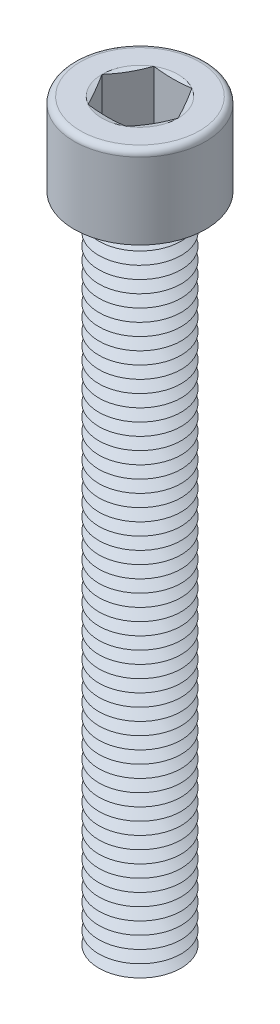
ISO-10303-21;
HEADER;
FILE_DESCRIPTION(('STEP AP214'),'2;1');
FILE_NAME('part.step','',(''),(''),'','','');
FILE_SCHEMA(('AUTOMOTIVE_DESIGN { 1 0 10303 214 1 1 1 1 }'));
ENDSEC;
DATA;
#1=APPLICATION_CONTEXT('core data for automotive mechanical design processes');
#2=APPLICATION_PROTOCOL_DEFINITION('international standard','automotive_design',2000,#1);
#3=PRODUCT_CONTEXT('',#1,'mechanical');
#4=PRODUCT('Part','Part','',(#3));
#5=PRODUCT_RELATED_PRODUCT_CATEGORY('part','',(#4));
#6=PRODUCT_DEFINITION_FORMATION('','',#4);
#7=PRODUCT_DEFINITION_CONTEXT('part definition',#1,'design');
#8=PRODUCT_DEFINITION('design','',#6,#7);
#9=PRODUCT_DEFINITION_SHAPE('','',#8);
#10=(LENGTH_UNIT() NAMED_UNIT(*) SI_UNIT(.MILLI.,.METRE.));
#11=(NAMED_UNIT(*) PLANE_ANGLE_UNIT() SI_UNIT($,.RADIAN.));
#12=(NAMED_UNIT(*) SI_UNIT($,.STERADIAN.) SOLID_ANGLE_UNIT());
#13=UNCERTAINTY_MEASURE_WITH_UNIT(LENGTH_MEASURE(1.E-05),#10,'distance_accuracy_value','');
#14=(GEOMETRIC_REPRESENTATION_CONTEXT(3) GLOBAL_UNCERTAINTY_ASSIGNED_CONTEXT((#13)) GLOBAL_UNIT_ASSIGNED_CONTEXT((#10,
#11,#12)) REPRESENTATION_CONTEXT('',''));
#15=CARTESIAN_POINT('',(0.,0.,0.));
#16=DIRECTION('',(0.,0.,1.));
#17=DIRECTION('',(1.,0.,0.));
#18=AXIS2_PLACEMENT_3D('',#15,#16,#17);
#19=CARTESIAN_POINT('',(0.,6.,0.));
#20=DIRECTION('',(0.,1.,0.));
#21=DIRECTION('',(0.,0.,1.));
#22=AXIS2_PLACEMENT_3D('',#19,#20,#21);
#23=CONICAL_SURFACE('',#22,3.70096189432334,1.0471975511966);
#24=CARTESIAN_POINT('',(0.,6.75,0.));
#25=DIRECTION('',(0.,1.,0.));
#26=DIRECTION('',(0.,0.,1.));
#27=AXIS2_PLACEMENT_3D('',#24,#25,#26);
#28=CIRCLE('',#27,5.);
#29=CARTESIAN_POINT('',(0.,6.75,5.));
#30=VERTEX_POINT('',#29);
#31=EDGE_CURVE('E734',#30,#30,#28,.T.);
#32=ORIENTED_EDGE('',*,*,#31,.F.);
#33=EDGE_LOOP('',(#32));
#34=FACE_BOUND('',#33,.T.);
#35=CARTESIAN_POINT('',(0.,6.,0.));
#36=DIRECTION('',(0.,1.,0.));
#37=DIRECTION('',(0.,0.,1.));
#38=AXIS2_PLACEMENT_3D('',#35,#36,#37);
#39=CIRCLE('',#38,3.70096189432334);
#40=CARTESIAN_POINT('',(0.,6.,3.70096189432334));
#41=VERTEX_POINT('',#40);
#42=EDGE_CURVE('E738',#41,#41,#39,.T.);
#43=ORIENTED_EDGE('',*,*,#42,.T.);
#44=EDGE_LOOP('',(#43));
#45=FACE_BOUND('',#44,.T.);
#46=ADVANCED_FACE('F41',(#34,#45),#23,.T.);
#47=CARTESIAN_POINT('',(0.,5.25,0.));
#48=DIRECTION('',(0.,-1.,0.));
#49=DIRECTION('',(0.,0.,-1.));
#50=AXIS2_PLACEMENT_3D('',#47,#48,#49);
#51=CONICAL_SURFACE('',#50,5.,1.0471975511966);
#52=ORIENTED_EDGE('',*,*,#42,.F.);
#53=EDGE_LOOP('',(#52));
#54=FACE_BOUND('',#53,.T.);
#55=CARTESIAN_POINT('',(0.,5.25,0.));
#56=DIRECTION('',(0.,1.,0.));
#57=DIRECTION('',(0.,0.,1.));
#58=AXIS2_PLACEMENT_3D('',#55,#56,#57);
#59=CIRCLE('',#58,5.);
#60=CARTESIAN_POINT('',(0.,5.25,5.));
#61=VERTEX_POINT('',#60);
#62=EDGE_CURVE('E742',#61,#61,#59,.T.);
#63=ORIENTED_EDGE('',*,*,#62,.T.);
#64=EDGE_LOOP('',(#63));
#65=FACE_BOUND('',#64,.T.);
#66=ADVANCED_FACE('F251',(#54,#65),#51,.T.);
#67=CARTESIAN_POINT('',(0.,0.,0.));
#68=DIRECTION('',(0.,1.,0.));
#69=DIRECTION('',(0.,0.,1.));
#70=AXIS2_PLACEMENT_3D('',#67,#68,#69);
#71=PLANE('',#70);
#72=CARTESIAN_POINT('',(0.,0.,0.));
#73=DIRECTION('',(0.,1.,0.));
#74=DIRECTION('',(0.,0.,1.));
#75=AXIS2_PLACEMENT_3D('',#72,#73,#74);
#76=CIRCLE('',#75,3.70096189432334);
#77=CARTESIAN_POINT('',(0.,0.,3.70096189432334));
#78=VERTEX_POINT('',#77);
#79=EDGE_CURVE('E769',#78,#78,#76,.T.);
#80=ORIENTED_EDGE('',*,*,#79,.F.);
#81=EDGE_LOOP('',(#80));
#82=FACE_BOUND('',#81,.T.);
#83=ADVANCED_FACE('F248',(#82),#71,.F.);
#84=CARTESIAN_POINT('',(0.,0.,0.));
#85=DIRECTION('',(0.,1.,0.));
#86=DIRECTION('',(0.,0.,1.));
#87=AXIS2_PLACEMENT_3D('',#84,#85,#86);
#88=CONICAL_SURFACE('',#87,3.70096189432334,1.0471975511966);
#89=CARTESIAN_POINT('',(0.,0.749999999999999,0.));
#90=DIRECTION('',(0.,1.,0.));
#91=DIRECTION('',(0.,0.,1.));
#92=AXIS2_PLACEMENT_3D('',#89,#90,#91);
#93=CIRCLE('',#92,5.);
#94=CARTESIAN_POINT('',(0.,0.749999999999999,5.));
#95=VERTEX_POINT('',#94);
#96=EDGE_CURVE('E765',#95,#95,#93,.T.);
#97=ORIENTED_EDGE('',*,*,#96,.F.);
#98=EDGE_LOOP('',(#97));
#99=FACE_BOUND('',#98,.T.);
#100=ORIENTED_EDGE('',*,*,#79,.T.);
#101=EDGE_LOOP('',(#100));
#102=FACE_BOUND('',#101,.T.);
#103=ADVANCED_FACE('F250',(#99,#102),#88,.T.);
#104=CARTESIAN_POINT('',(0.,0.749999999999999,0.));
#105=DIRECTION('',(0.,-1.,0.));
#106=DIRECTION('',(0.,0.,-1.));
#107=AXIS2_PLACEMENT_3D('',#104,#105,#106);
#108=CONICAL_SURFACE('',#107,5.,1.0471975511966);
#109=CARTESIAN_POINT('',(0.,1.5,0.));
#110=DIRECTION('',(0.,1.,0.));
#111=DIRECTION('',(0.,0.,1.));
#112=AXIS2_PLACEMENT_3D('',#109,#110,#111);
#113=CIRCLE('',#112,3.70096189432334);
#114=CARTESIAN_POINT('',(0.,1.5,3.70096189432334));
#115=VERTEX_POINT('',#114);
#116=EDGE_CURVE('E761',#115,#115,#113,.T.);
#117=ORIENTED_EDGE('',*,*,#116,.F.);
#118=EDGE_LOOP('',(#117));
#119=FACE_BOUND('',#118,.T.);
#120=ORIENTED_EDGE('',*,*,#96,.T.);
#121=EDGE_LOOP('',(#120));
#122=FACE_BOUND('',#121,.T.);
#123=ADVANCED_FACE('F291',(#119,#122),#108,.T.);
#124=CARTESIAN_POINT('',(0.,1.5,0.));
#125=DIRECTION('',(0.,1.,0.));
#126=DIRECTION('',(0.,0.,1.));
#127=AXIS2_PLACEMENT_3D('',#124,#125,#126);
#128=CONICAL_SURFACE('',#127,3.70096189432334,1.0471975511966);
#129=CARTESIAN_POINT('',(0.,2.25,0.));
#130=DIRECTION('',(0.,1.,0.));
#131=DIRECTION('',(0.,0.,1.));
#132=AXIS2_PLACEMENT_3D('',#129,#130,#131);
#133=CIRCLE('',#132,5.);
#134=CARTESIAN_POINT('',(0.,2.25,5.));
#135=VERTEX_POINT('',#134);
#136=EDGE_CURVE('E758',#135,#135,#133,.T.);
#137=ORIENTED_EDGE('',*,*,#136,.F.);
#138=EDGE_LOOP('',(#137));
#139=FACE_BOUND('',#138,.T.);
#140=ORIENTED_EDGE('',*,*,#116,.T.);
#141=EDGE_LOOP('',(#140));
#142=FACE_BOUND('',#141,.T.);
#143=ADVANCED_FACE('F286',(#139,#142),#128,.T.);
#144=CARTESIAN_POINT('',(0.,2.25,0.));
#145=DIRECTION('',(0.,-1.,0.));
#146=DIRECTION('',(0.,0.,-1.));
#147=AXIS2_PLACEMENT_3D('',#144,#145,#146);
#148=CONICAL_SURFACE('',#147,5.,1.0471975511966);
#149=CARTESIAN_POINT('',(0.,3.,0.));
#150=DIRECTION('',(0.,1.,0.));
#151=DIRECTION('',(0.,0.,1.));
#152=AXIS2_PLACEMENT_3D('',#149,#150,#151);
#153=CIRCLE('',#152,3.70096189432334);
#154=CARTESIAN_POINT('',(0.,3.,3.70096189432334));
#155=VERTEX_POINT('',#154);
#156=EDGE_CURVE('E754',#155,#155,#153,.T.);
#157=ORIENTED_EDGE('',*,*,#156,.F.);
#158=EDGE_LOOP('',(#157));
#159=FACE_BOUND('',#158,.T.);
#160=ORIENTED_EDGE('',*,*,#136,.T.);
#161=EDGE_LOOP('',(#160));
#162=FACE_BOUND('',#161,.T.);
#163=ADVANCED_FACE('F283',(#159,#162),#148,.T.);
#164=CARTESIAN_POINT('',(0.,3.,0.));
#165=DIRECTION('',(0.,1.,0.));
#166=DIRECTION('',(0.,0.,1.));
#167=AXIS2_PLACEMENT_3D('',#164,#165,#166);
#168=CONICAL_SURFACE('',#167,3.70096189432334,1.0471975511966);
#169=CARTESIAN_POINT('',(0.,3.75,0.));
#170=DIRECTION('',(0.,1.,0.));
#171=DIRECTION('',(0.,0.,1.));
#172=AXIS2_PLACEMENT_3D('',#169,#170,#171);
#173=CIRCLE('',#172,5.);
#174=CARTESIAN_POINT('',(0.,3.75,5.));
#175=VERTEX_POINT('',#174);
#176=EDGE_CURVE('E750',#175,#175,#173,.T.);
#177=ORIENTED_EDGE('',*,*,#176,.F.);
#178=EDGE_LOOP('',(#177));
#179=FACE_BOUND('',#178,.T.);
#180=ORIENTED_EDGE('',*,*,#156,.T.);
#181=EDGE_LOOP('',(#180));
#182=FACE_BOUND('',#181,.T.);
#183=ADVANCED_FACE('F277',(#179,#182),#168,.T.);
#184=CARTESIAN_POINT('',(0.,3.75,0.));
#185=DIRECTION('',(0.,-1.,0.));
#186=DIRECTION('',(0.,0.,-1.));
#187=AXIS2_PLACEMENT_3D('',#184,#185,#186);
#188=CONICAL_SURFACE('',#187,5.,1.0471975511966);
#189=CARTESIAN_POINT('',(0.,4.5,0.));
#190=DIRECTION('',(0.,1.,0.));
#191=DIRECTION('',(0.,0.,1.));
#192=AXIS2_PLACEMENT_3D('',#189,#190,#191);
#193=CIRCLE('',#192,3.70096189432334);
#194=CARTESIAN_POINT('',(0.,4.5,3.70096189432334));
#195=VERTEX_POINT('',#194);
#196=EDGE_CURVE('E746',#195,#195,#193,.T.);
#197=ORIENTED_EDGE('',*,*,#196,.F.);
#198=EDGE_LOOP('',(#197));
#199=FACE_BOUND('',#198,.T.);
#200=ORIENTED_EDGE('',*,*,#176,.T.);
#201=EDGE_LOOP('',(#200));
#202=FACE_BOUND('',#201,.T.);
#203=ADVANCED_FACE('F273',(#199,#202),#188,.T.);
#204=CARTESIAN_POINT('',(0.,4.5,0.));
#205=DIRECTION('',(0.,1.,0.));
#206=DIRECTION('',(0.,0.,1.));
#207=AXIS2_PLACEMENT_3D('',#204,#205,#206);
#208=CONICAL_SURFACE('',#207,3.70096189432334,1.0471975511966);
#209=ORIENTED_EDGE('',*,*,#62,.F.);
#210=EDGE_LOOP('',(#209));
#211=FACE_BOUND('',#210,.T.);
#212=ORIENTED_EDGE('',*,*,#196,.T.);
#213=EDGE_LOOP('',(#212));
#214=FACE_BOUND('',#213,.T.);
#215=ADVANCED_FACE('F276',(#211,#214),#208,.T.);
#216=CARTESIAN_POINT('',(0.,7.5,0.));
#217=DIRECTION('',(0.,1.,0.));
#218=DIRECTION('',(0.,0.,1.));
#219=AXIS2_PLACEMENT_3D('',#216,#217,#218);
#220=CONICAL_SURFACE('',#219,3.70096189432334,1.0471975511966);
#221=CARTESIAN_POINT('',(0.,8.25,0.));
#222=DIRECTION('',(0.,1.,0.));
#223=DIRECTION('',(0.,0.,1.));
#224=AXIS2_PLACEMENT_3D('',#221,#222,#223);
#225=CIRCLE('',#224,5.);
#226=CARTESIAN_POINT('',(0.,8.25,5.));
#227=VERTEX_POINT('',#226);
#228=EDGE_CURVE('E726',#227,#227,#225,.T.);
#229=ORIENTED_EDGE('',*,*,#228,.F.);
#230=EDGE_LOOP('',(#229));
#231=FACE_BOUND('',#230,.T.);
#232=CARTESIAN_POINT('',(0.,7.5,0.));
#233=DIRECTION('',(0.,1.,0.));
#234=DIRECTION('',(0.,0.,1.));
#235=AXIS2_PLACEMENT_3D('',#232,#233,#234);
#236=CIRCLE('',#235,3.70096189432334);
#237=CARTESIAN_POINT('',(0.,7.5,3.70096189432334));
#238=VERTEX_POINT('',#237);
#239=EDGE_CURVE('E730',#238,#238,#236,.T.);
#240=ORIENTED_EDGE('',*,*,#239,.T.);
#241=EDGE_LOOP('',(#240));
#242=FACE_BOUND('',#241,.T.);
#243=ADVANCED_FACE('F281',(#231,#242),#220,.T.);
#244=CARTESIAN_POINT('',(0.,6.75,0.));
#245=DIRECTION('',(0.,-1.,0.));
#246=DIRECTION('',(0.,0.,-1.));
#247=AXIS2_PLACEMENT_3D('',#244,#245,#246);
#248=CONICAL_SURFACE('',#247,5.,1.0471975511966);
#249=ORIENTED_EDGE('',*,*,#239,.F.);
#250=EDGE_LOOP('',(#249));
#251=FACE_BOUND('',#250,.T.);
#252=ORIENTED_EDGE('',*,*,#31,.T.);
#253=EDGE_LOOP('',(#252));
#254=FACE_BOUND('',#253,.T.);
#255=ADVANCED_FACE('F1012',(#251,#254),#248,.T.);
#256=CARTESIAN_POINT('',(0.,9.,0.));
#257=DIRECTION('',(0.,1.,0.));
#258=DIRECTION('',(0.,0.,1.));
#259=AXIS2_PLACEMENT_3D('',#256,#257,#258);
#260=CONICAL_SURFACE('',#259,3.70096189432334,1.0471975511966);
#261=CARTESIAN_POINT('',(0.,9.75,0.));
#262=DIRECTION('',(0.,1.,0.));
#263=DIRECTION('',(0.,0.,1.));
#264=AXIS2_PLACEMENT_3D('',#261,#262,#263);
#265=CIRCLE('',#264,5.);
#266=CARTESIAN_POINT('',(0.,9.75,5.));
#267=VERTEX_POINT('',#266);
#268=EDGE_CURVE('E718',#267,#267,#265,.T.);
#269=ORIENTED_EDGE('',*,*,#268,.F.);
#270=EDGE_LOOP('',(#269));
#271=FACE_BOUND('',#270,.T.);
#272=CARTESIAN_POINT('',(0.,9.,0.));
#273=DIRECTION('',(0.,1.,0.));
#274=DIRECTION('',(0.,0.,1.));
#275=AXIS2_PLACEMENT_3D('',#272,#273,#274);
#276=CIRCLE('',#275,3.70096189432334);
#277=CARTESIAN_POINT('',(0.,9.,3.70096189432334));
#278=VERTEX_POINT('',#277);
#279=EDGE_CURVE('E722',#278,#278,#276,.T.);
#280=ORIENTED_EDGE('',*,*,#279,.T.);
#281=EDGE_LOOP('',(#280));
#282=FACE_BOUND('',#281,.T.);
#283=ADVANCED_FACE('F1021',(#271,#282),#260,.T.);
#284=CARTESIAN_POINT('',(0.,8.25,0.));
#285=DIRECTION('',(0.,-1.,0.));
#286=DIRECTION('',(0.,0.,-1.));
#287=AXIS2_PLACEMENT_3D('',#284,#285,#286);
#288=CONICAL_SURFACE('',#287,5.,1.0471975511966);
#289=ORIENTED_EDGE('',*,*,#279,.F.);
#290=EDGE_LOOP('',(#289));
#291=FACE_BOUND('',#290,.T.);
#292=ORIENTED_EDGE('',*,*,#228,.T.);
#293=EDGE_LOOP('',(#292));
#294=FACE_BOUND('',#293,.T.);
#295=ADVANCED_FACE('F1031',(#291,#294),#288,.T.);
#296=CARTESIAN_POINT('',(0.,10.5,0.));
#297=DIRECTION('',(0.,1.,0.));
#298=DIRECTION('',(0.,0.,1.));
#299=AXIS2_PLACEMENT_3D('',#296,#297,#298);
#300=CONICAL_SURFACE('',#299,3.70096189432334,1.0471975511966);
#301=CARTESIAN_POINT('',(0.,11.25,0.));
#302=DIRECTION('',(0.,1.,0.));
#303=DIRECTION('',(0.,0.,1.));
#304=AXIS2_PLACEMENT_3D('',#301,#302,#303);
#305=CIRCLE('',#304,5.);
#306=CARTESIAN_POINT('',(0.,11.25,5.));
#307=VERTEX_POINT('',#306);
#308=EDGE_CURVE('E710',#307,#307,#305,.T.);
#309=ORIENTED_EDGE('',*,*,#308,.F.);
#310=EDGE_LOOP('',(#309));
#311=FACE_BOUND('',#310,.T.);
#312=CARTESIAN_POINT('',(0.,10.5,0.));
#313=DIRECTION('',(0.,1.,0.));
#314=DIRECTION('',(0.,0.,1.));
#315=AXIS2_PLACEMENT_3D('',#312,#313,#314);
#316=CIRCLE('',#315,3.70096189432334);
#317=CARTESIAN_POINT('',(0.,10.5,3.70096189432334));
#318=VERTEX_POINT('',#317);
#319=EDGE_CURVE('E714',#318,#318,#316,.T.);
#320=ORIENTED_EDGE('',*,*,#319,.T.);
#321=EDGE_LOOP('',(#320));
#322=FACE_BOUND('',#321,.T.);
#323=ADVANCED_FACE('F1041',(#311,#322),#300,.T.);
#324=CARTESIAN_POINT('',(0.,9.75,0.));
#325=DIRECTION('',(0.,-1.,0.));
#326=DIRECTION('',(0.,0.,-1.));
#327=AXIS2_PLACEMENT_3D('',#324,#325,#326);
#328=CONICAL_SURFACE('',#327,5.,1.0471975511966);
#329=ORIENTED_EDGE('',*,*,#319,.F.);
#330=EDGE_LOOP('',(#329));
#331=FACE_BOUND('',#330,.T.);
#332=ORIENTED_EDGE('',*,*,#268,.T.);
#333=EDGE_LOOP('',(#332));
#334=FACE_BOUND('',#333,.T.);
#335=ADVANCED_FACE('F1051',(#331,#334),#328,.T.);
#336=CARTESIAN_POINT('',(0.,12.,0.));
#337=DIRECTION('',(0.,1.,0.));
#338=DIRECTION('',(0.,0.,1.));
#339=AXIS2_PLACEMENT_3D('',#336,#337,#338);
#340=CONICAL_SURFACE('',#339,3.70096189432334,1.0471975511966);
#341=CARTESIAN_POINT('',(0.,12.75,0.));
#342=DIRECTION('',(0.,1.,0.));
#343=DIRECTION('',(0.,0.,1.));
#344=AXIS2_PLACEMENT_3D('',#341,#342,#343);
#345=CIRCLE('',#344,5.);
#346=CARTESIAN_POINT('',(0.,12.75,5.));
#347=VERTEX_POINT('',#346);
#348=EDGE_CURVE('E702',#347,#347,#345,.T.);
#349=ORIENTED_EDGE('',*,*,#348,.F.);
#350=EDGE_LOOP('',(#349));
#351=FACE_BOUND('',#350,.T.);
#352=CARTESIAN_POINT('',(0.,12.,0.));
#353=DIRECTION('',(0.,1.,0.));
#354=DIRECTION('',(0.,0.,1.));
#355=AXIS2_PLACEMENT_3D('',#352,#353,#354);
#356=CIRCLE('',#355,3.70096189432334);
#357=CARTESIAN_POINT('',(0.,12.,3.70096189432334));
#358=VERTEX_POINT('',#357);
#359=EDGE_CURVE('E706',#358,#358,#356,.T.);
#360=ORIENTED_EDGE('',*,*,#359,.T.);
#361=EDGE_LOOP('',(#360));
#362=FACE_BOUND('',#361,.T.);
#363=ADVANCED_FACE('F1061',(#351,#362),#340,.T.);
#364=CARTESIAN_POINT('',(0.,11.25,0.));
#365=DIRECTION('',(0.,-1.,0.));
#366=DIRECTION('',(0.,0.,-1.));
#367=AXIS2_PLACEMENT_3D('',#364,#365,#366);
#368=CONICAL_SURFACE('',#367,5.,1.0471975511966);
#369=ORIENTED_EDGE('',*,*,#359,.F.);
#370=EDGE_LOOP('',(#369));
#371=FACE_BOUND('',#370,.T.);
#372=ORIENTED_EDGE('',*,*,#308,.T.);
#373=EDGE_LOOP('',(#372));
#374=FACE_BOUND('',#373,.T.);
#375=ADVANCED_FACE('F1071',(#371,#374),#368,.T.);
#376=CARTESIAN_POINT('',(0.,13.5,0.));
#377=DIRECTION('',(0.,1.,0.));
#378=DIRECTION('',(0.,0.,1.));
#379=AXIS2_PLACEMENT_3D('',#376,#377,#378);
#380=CONICAL_SURFACE('',#379,3.70096189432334,1.0471975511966);
#381=CARTESIAN_POINT('',(0.,14.25,0.));
#382=DIRECTION('',(0.,1.,0.));
#383=DIRECTION('',(0.,0.,1.));
#384=AXIS2_PLACEMENT_3D('',#381,#382,#383);
#385=CIRCLE('',#384,5.);
#386=CARTESIAN_POINT('',(0.,14.25,5.));
#387=VERTEX_POINT('',#386);
#388=EDGE_CURVE('E694',#387,#387,#385,.T.);
#389=ORIENTED_EDGE('',*,*,#388,.F.);
#390=EDGE_LOOP('',(#389));
#391=FACE_BOUND('',#390,.T.);
#392=CARTESIAN_POINT('',(0.,13.5,0.));
#393=DIRECTION('',(0.,1.,0.));
#394=DIRECTION('',(0.,0.,1.));
#395=AXIS2_PLACEMENT_3D('',#392,#393,#394);
#396=CIRCLE('',#395,3.70096189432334);
#397=CARTESIAN_POINT('',(0.,13.5,3.70096189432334));
#398=VERTEX_POINT('',#397);
#399=EDGE_CURVE('E698',#398,#398,#396,.T.);
#400=ORIENTED_EDGE('',*,*,#399,.T.);
#401=EDGE_LOOP('',(#400));
#402=FACE_BOUND('',#401,.T.);
#403=ADVANCED_FACE('F1081',(#391,#402),#380,.T.);
#404=CARTESIAN_POINT('',(0.,12.75,0.));
#405=DIRECTION('',(0.,-1.,0.));
#406=DIRECTION('',(0.,0.,-1.));
#407=AXIS2_PLACEMENT_3D('',#404,#405,#406);
#408=CONICAL_SURFACE('',#407,5.,1.0471975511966);
#409=ORIENTED_EDGE('',*,*,#399,.F.);
#410=EDGE_LOOP('',(#409));
#411=FACE_BOUND('',#410,.T.);
#412=ORIENTED_EDGE('',*,*,#348,.T.);
#413=EDGE_LOOP('',(#412));
#414=FACE_BOUND('',#413,.T.);
#415=ADVANCED_FACE('F1091',(#411,#414),#408,.T.);
#416=CARTESIAN_POINT('',(0.,15.,0.));
#417=DIRECTION('',(0.,1.,0.));
#418=DIRECTION('',(0.,0.,1.));
#419=AXIS2_PLACEMENT_3D('',#416,#417,#418);
#420=CONICAL_SURFACE('',#419,3.70096189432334,1.0471975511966);
#421=CARTESIAN_POINT('',(0.,15.75,0.));
#422=DIRECTION('',(0.,1.,0.));
#423=DIRECTION('',(0.,0.,1.));
#424=AXIS2_PLACEMENT_3D('',#421,#422,#423);
#425=CIRCLE('',#424,5.);
#426=CARTESIAN_POINT('',(0.,15.75,5.));
#427=VERTEX_POINT('',#426);
#428=EDGE_CURVE('E686',#427,#427,#425,.T.);
#429=ORIENTED_EDGE('',*,*,#428,.F.);
#430=EDGE_LOOP('',(#429));
#431=FACE_BOUND('',#430,.T.);
#432=CARTESIAN_POINT('',(0.,15.,0.));
#433=DIRECTION('',(0.,1.,0.));
#434=DIRECTION('',(0.,0.,1.));
#435=AXIS2_PLACEMENT_3D('',#432,#433,#434);
#436=CIRCLE('',#435,3.70096189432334);
#437=CARTESIAN_POINT('',(0.,15.,3.70096189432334));
#438=VERTEX_POINT('',#437);
#439=EDGE_CURVE('E690',#438,#438,#436,.T.);
#440=ORIENTED_EDGE('',*,*,#439,.T.);
#441=EDGE_LOOP('',(#440));
#442=FACE_BOUND('',#441,.T.);
#443=ADVANCED_FACE('F1101',(#431,#442),#420,.T.);
#444=CARTESIAN_POINT('',(0.,14.25,0.));
#445=DIRECTION('',(0.,-1.,0.));
#446=DIRECTION('',(0.,0.,-1.));
#447=AXIS2_PLACEMENT_3D('',#444,#445,#446);
#448=CONICAL_SURFACE('',#447,5.,1.0471975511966);
#449=ORIENTED_EDGE('',*,*,#439,.F.);
#450=EDGE_LOOP('',(#449));
#451=FACE_BOUND('',#450,.T.);
#452=ORIENTED_EDGE('',*,*,#388,.T.);
#453=EDGE_LOOP('',(#452));
#454=FACE_BOUND('',#453,.T.);
#455=ADVANCED_FACE('F1111',(#451,#454),#448,.T.);
#456=CARTESIAN_POINT('',(0.,16.5,0.));
#457=DIRECTION('',(0.,1.,0.));
#458=DIRECTION('',(0.,0.,1.));
#459=AXIS2_PLACEMENT_3D('',#456,#457,#458);
#460=CONICAL_SURFACE('',#459,3.70096189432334,1.0471975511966);
#461=CARTESIAN_POINT('',(0.,17.25,0.));
#462=DIRECTION('',(0.,1.,0.));
#463=DIRECTION('',(0.,0.,1.));
#464=AXIS2_PLACEMENT_3D('',#461,#462,#463);
#465=CIRCLE('',#464,5.);
#466=CARTESIAN_POINT('',(0.,17.25,5.));
#467=VERTEX_POINT('',#466);
#468=EDGE_CURVE('E678',#467,#467,#465,.T.);
#469=ORIENTED_EDGE('',*,*,#468,.F.);
#470=EDGE_LOOP('',(#469));
#471=FACE_BOUND('',#470,.T.);
#472=CARTESIAN_POINT('',(0.,16.5,0.));
#473=DIRECTION('',(0.,1.,0.));
#474=DIRECTION('',(0.,0.,1.));
#475=AXIS2_PLACEMENT_3D('',#472,#473,#474);
#476=CIRCLE('',#475,3.70096189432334);
#477=CARTESIAN_POINT('',(0.,16.5,3.70096189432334));
#478=VERTEX_POINT('',#477);
#479=EDGE_CURVE('E682',#478,#478,#476,.T.);
#480=ORIENTED_EDGE('',*,*,#479,.T.);
#481=EDGE_LOOP('',(#480));
#482=FACE_BOUND('',#481,.T.);
#483=ADVANCED_FACE('F1121',(#471,#482),#460,.T.);
#484=CARTESIAN_POINT('',(0.,15.75,0.));
#485=DIRECTION('',(0.,-1.,0.));
#486=DIRECTION('',(0.,0.,-1.));
#487=AXIS2_PLACEMENT_3D('',#484,#485,#486);
#488=CONICAL_SURFACE('',#487,5.,1.0471975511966);
#489=ORIENTED_EDGE('',*,*,#479,.F.);
#490=EDGE_LOOP('',(#489));
#491=FACE_BOUND('',#490,.T.);
#492=ORIENTED_EDGE('',*,*,#428,.T.);
#493=EDGE_LOOP('',(#492));
#494=FACE_BOUND('',#493,.T.);
#495=ADVANCED_FACE('F1131',(#491,#494),#488,.T.);
#496=CARTESIAN_POINT('',(0.,18.,0.));
#497=DIRECTION('',(0.,1.,0.));
#498=DIRECTION('',(0.,0.,1.));
#499=AXIS2_PLACEMENT_3D('',#496,#497,#498);
#500=CONICAL_SURFACE('',#499,3.70096189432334,1.0471975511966);
#501=CARTESIAN_POINT('',(0.,18.75,0.));
#502=DIRECTION('',(0.,1.,0.));
#503=DIRECTION('',(0.,0.,1.));
#504=AXIS2_PLACEMENT_3D('',#501,#502,#503);
#505=CIRCLE('',#504,5.);
#506=CARTESIAN_POINT('',(0.,18.75,5.));
#507=VERTEX_POINT('',#506);
#508=EDGE_CURVE('E670',#507,#507,#505,.T.);
#509=ORIENTED_EDGE('',*,*,#508,.F.);
#510=EDGE_LOOP('',(#509));
#511=FACE_BOUND('',#510,.T.);
#512=CARTESIAN_POINT('',(0.,18.,0.));
#513=DIRECTION('',(0.,1.,0.));
#514=DIRECTION('',(0.,0.,1.));
#515=AXIS2_PLACEMENT_3D('',#512,#513,#514);
#516=CIRCLE('',#515,3.70096189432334);
#517=CARTESIAN_POINT('',(0.,18.,3.70096189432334));
#518=VERTEX_POINT('',#517);
#519=EDGE_CURVE('E674',#518,#518,#516,.T.);
#520=ORIENTED_EDGE('',*,*,#519,.T.);
#521=EDGE_LOOP('',(#520));
#522=FACE_BOUND('',#521,.T.);
#523=ADVANCED_FACE('F1141',(#511,#522),#500,.T.);
#524=CARTESIAN_POINT('',(0.,17.25,0.));
#525=DIRECTION('',(0.,-1.,0.));
#526=DIRECTION('',(0.,0.,-1.));
#527=AXIS2_PLACEMENT_3D('',#524,#525,#526);
#528=CONICAL_SURFACE('',#527,5.,1.0471975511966);
#529=ORIENTED_EDGE('',*,*,#519,.F.);
#530=EDGE_LOOP('',(#529));
#531=FACE_BOUND('',#530,.T.);
#532=ORIENTED_EDGE('',*,*,#468,.T.);
#533=EDGE_LOOP('',(#532));
#534=FACE_BOUND('',#533,.T.);
#535=ADVANCED_FACE('F1151',(#531,#534),#528,.T.);
#536=CARTESIAN_POINT('',(0.,19.5,0.));
#537=DIRECTION('',(0.,1.,0.));
#538=DIRECTION('',(0.,0.,1.));
#539=AXIS2_PLACEMENT_3D('',#536,#537,#538);
#540=CONICAL_SURFACE('',#539,3.70096189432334,1.0471975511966);
#541=CARTESIAN_POINT('',(0.,20.25,0.));
#542=DIRECTION('',(0.,1.,0.));
#543=DIRECTION('',(0.,0.,1.));
#544=AXIS2_PLACEMENT_3D('',#541,#542,#543);
#545=CIRCLE('',#544,5.);
#546=CARTESIAN_POINT('',(0.,20.25,5.));
#547=VERTEX_POINT('',#546);
#548=EDGE_CURVE('E662',#547,#547,#545,.T.);
#549=ORIENTED_EDGE('',*,*,#548,.F.);
#550=EDGE_LOOP('',(#549));
#551=FACE_BOUND('',#550,.T.);
#552=CARTESIAN_POINT('',(0.,19.5,0.));
#553=DIRECTION('',(0.,1.,0.));
#554=DIRECTION('',(0.,0.,1.));
#555=AXIS2_PLACEMENT_3D('',#552,#553,#554);
#556=CIRCLE('',#555,3.70096189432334);
#557=CARTESIAN_POINT('',(0.,19.5,3.70096189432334));
#558=VERTEX_POINT('',#557);
#559=EDGE_CURVE('E666',#558,#558,#556,.T.);
#560=ORIENTED_EDGE('',*,*,#559,.T.);
#561=EDGE_LOOP('',(#560));
#562=FACE_BOUND('',#561,.T.);
#563=ADVANCED_FACE('F1161',(#551,#562),#540,.T.);
#564=CARTESIAN_POINT('',(0.,18.75,0.));
#565=DIRECTION('',(0.,-1.,0.));
#566=DIRECTION('',(0.,0.,-1.));
#567=AXIS2_PLACEMENT_3D('',#564,#565,#566);
#568=CONICAL_SURFACE('',#567,5.,1.0471975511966);
#569=ORIENTED_EDGE('',*,*,#559,.F.);
#570=EDGE_LOOP('',(#569));
#571=FACE_BOUND('',#570,.T.);
#572=ORIENTED_EDGE('',*,*,#508,.T.);
#573=EDGE_LOOP('',(#572));
#574=FACE_BOUND('',#573,.T.);
#575=ADVANCED_FACE('F1171',(#571,#574),#568,.T.);
#576=CARTESIAN_POINT('',(0.,21.,0.));
#577=DIRECTION('',(0.,1.,0.));
#578=DIRECTION('',(0.,0.,1.));
#579=AXIS2_PLACEMENT_3D('',#576,#577,#578);
#580=CONICAL_SURFACE('',#579,3.70096189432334,1.0471975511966);
#581=CARTESIAN_POINT('',(0.,21.75,0.));
#582=DIRECTION('',(0.,1.,0.));
#583=DIRECTION('',(0.,0.,1.));
#584=AXIS2_PLACEMENT_3D('',#581,#582,#583);
#585=CIRCLE('',#584,5.);
#586=CARTESIAN_POINT('',(0.,21.75,5.));
#587=VERTEX_POINT('',#586);
#588=EDGE_CURVE('E654',#587,#587,#585,.T.);
#589=ORIENTED_EDGE('',*,*,#588,.F.);
#590=EDGE_LOOP('',(#589));
#591=FACE_BOUND('',#590,.T.);
#592=CARTESIAN_POINT('',(0.,21.,0.));
#593=DIRECTION('',(0.,1.,0.));
#594=DIRECTION('',(0.,0.,1.));
#595=AXIS2_PLACEMENT_3D('',#592,#593,#594);
#596=CIRCLE('',#595,3.70096189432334);
#597=CARTESIAN_POINT('',(0.,21.,3.70096189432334));
#598=VERTEX_POINT('',#597);
#599=EDGE_CURVE('E658',#598,#598,#596,.T.);
#600=ORIENTED_EDGE('',*,*,#599,.T.);
#601=EDGE_LOOP('',(#600));
#602=FACE_BOUND('',#601,.T.);
#603=ADVANCED_FACE('F1181',(#591,#602),#580,.T.);
#604=CARTESIAN_POINT('',(0.,20.25,0.));
#605=DIRECTION('',(0.,-1.,0.));
#606=DIRECTION('',(0.,0.,-1.));
#607=AXIS2_PLACEMENT_3D('',#604,#605,#606);
#608=CONICAL_SURFACE('',#607,5.,1.0471975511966);
#609=ORIENTED_EDGE('',*,*,#599,.F.);
#610=EDGE_LOOP('',(#609));
#611=FACE_BOUND('',#610,.T.);
#612=ORIENTED_EDGE('',*,*,#548,.T.);
#613=EDGE_LOOP('',(#612));
#614=FACE_BOUND('',#613,.T.);
#615=ADVANCED_FACE('F1191',(#611,#614),#608,.T.);
#616=CARTESIAN_POINT('',(0.,22.5,0.));
#617=DIRECTION('',(0.,1.,0.));
#618=DIRECTION('',(0.,0.,1.));
#619=AXIS2_PLACEMENT_3D('',#616,#617,#618);
#620=CONICAL_SURFACE('',#619,3.70096189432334,1.0471975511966);
#621=CARTESIAN_POINT('',(0.,23.25,0.));
#622=DIRECTION('',(0.,1.,0.));
#623=DIRECTION('',(0.,0.,1.));
#624=AXIS2_PLACEMENT_3D('',#621,#622,#623);
#625=CIRCLE('',#624,5.);
#626=CARTESIAN_POINT('',(0.,23.25,5.));
#627=VERTEX_POINT('',#626);
#628=EDGE_CURVE('E646',#627,#627,#625,.T.);
#629=ORIENTED_EDGE('',*,*,#628,.F.);
#630=EDGE_LOOP('',(#629));
#631=FACE_BOUND('',#630,.T.);
#632=CARTESIAN_POINT('',(0.,22.5,0.));
#633=DIRECTION('',(0.,1.,0.));
#634=DIRECTION('',(0.,0.,1.));
#635=AXIS2_PLACEMENT_3D('',#632,#633,#634);
#636=CIRCLE('',#635,3.70096189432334);
#637=CARTESIAN_POINT('',(0.,22.5,3.70096189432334));
#638=VERTEX_POINT('',#637);
#639=EDGE_CURVE('E650',#638,#638,#636,.T.);
#640=ORIENTED_EDGE('',*,*,#639,.T.);
#641=EDGE_LOOP('',(#640));
#642=FACE_BOUND('',#641,.T.);
#643=ADVANCED_FACE('F1201',(#631,#642),#620,.T.);
#644=CARTESIAN_POINT('',(0.,21.75,0.));
#645=DIRECTION('',(0.,-1.,0.));
#646=DIRECTION('',(0.,0.,-1.));
#647=AXIS2_PLACEMENT_3D('',#644,#645,#646);
#648=CONICAL_SURFACE('',#647,5.,1.0471975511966);
#649=ORIENTED_EDGE('',*,*,#639,.F.);
#650=EDGE_LOOP('',(#649));
#651=FACE_BOUND('',#650,.T.);
#652=ORIENTED_EDGE('',*,*,#588,.T.);
#653=EDGE_LOOP('',(#652));
#654=FACE_BOUND('',#653,.T.);
#655=ADVANCED_FACE('F1211',(#651,#654),#648,.T.);
#656=CARTESIAN_POINT('',(0.,24.,0.));
#657=DIRECTION('',(0.,1.,0.));
#658=DIRECTION('',(0.,0.,1.));
#659=AXIS2_PLACEMENT_3D('',#656,#657,#658);
#660=CONICAL_SURFACE('',#659,3.70096189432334,1.0471975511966);
#661=CARTESIAN_POINT('',(0.,24.75,0.));
#662=DIRECTION('',(0.,1.,0.));
#663=DIRECTION('',(0.,0.,1.));
#664=AXIS2_PLACEMENT_3D('',#661,#662,#663);
#665=CIRCLE('',#664,5.);
#666=CARTESIAN_POINT('',(0.,24.75,5.));
#667=VERTEX_POINT('',#666);
#668=EDGE_CURVE('E638',#667,#667,#665,.T.);
#669=ORIENTED_EDGE('',*,*,#668,.F.);
#670=EDGE_LOOP('',(#669));
#671=FACE_BOUND('',#670,.T.);
#672=CARTESIAN_POINT('',(0.,24.,0.));
#673=DIRECTION('',(0.,1.,0.));
#674=DIRECTION('',(0.,0.,1.));
#675=AXIS2_PLACEMENT_3D('',#672,#673,#674);
#676=CIRCLE('',#675,3.70096189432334);
#677=CARTESIAN_POINT('',(0.,24.,3.70096189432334));
#678=VERTEX_POINT('',#677);
#679=EDGE_CURVE('E642',#678,#678,#676,.T.);
#680=ORIENTED_EDGE('',*,*,#679,.T.);
#681=EDGE_LOOP('',(#680));
#682=FACE_BOUND('',#681,.T.);
#683=ADVANCED_FACE('F1221',(#671,#682),#660,.T.);
#684=CARTESIAN_POINT('',(0.,23.25,0.));
#685=DIRECTION('',(0.,-1.,0.));
#686=DIRECTION('',(0.,0.,-1.));
#687=AXIS2_PLACEMENT_3D('',#684,#685,#686);
#688=CONICAL_SURFACE('',#687,5.,1.0471975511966);
#689=ORIENTED_EDGE('',*,*,#679,.F.);
#690=EDGE_LOOP('',(#689));
#691=FACE_BOUND('',#690,.T.);
#692=ORIENTED_EDGE('',*,*,#628,.T.);
#693=EDGE_LOOP('',(#692));
#694=FACE_BOUND('',#693,.T.);
#695=ADVANCED_FACE('F1231',(#691,#694),#688,.T.);
#696=CARTESIAN_POINT('',(0.,25.5,0.));
#697=DIRECTION('',(0.,1.,0.));
#698=DIRECTION('',(0.,0.,1.));
#699=AXIS2_PLACEMENT_3D('',#696,#697,#698);
#700=CONICAL_SURFACE('',#699,3.70096189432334,1.0471975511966);
#701=CARTESIAN_POINT('',(0.,26.25,0.));
#702=DIRECTION('',(0.,1.,0.));
#703=DIRECTION('',(0.,0.,1.));
#704=AXIS2_PLACEMENT_3D('',#701,#702,#703);
#705=CIRCLE('',#704,5.);
#706=CARTESIAN_POINT('',(0.,26.25,5.));
#707=VERTEX_POINT('',#706);
#708=EDGE_CURVE('E630',#707,#707,#705,.T.);
#709=ORIENTED_EDGE('',*,*,#708,.F.);
#710=EDGE_LOOP('',(#709));
#711=FACE_BOUND('',#710,.T.);
#712=CARTESIAN_POINT('',(0.,25.5,0.));
#713=DIRECTION('',(0.,1.,0.));
#714=DIRECTION('',(0.,0.,1.));
#715=AXIS2_PLACEMENT_3D('',#712,#713,#714);
#716=CIRCLE('',#715,3.70096189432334);
#717=CARTESIAN_POINT('',(0.,25.5,3.70096189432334));
#718=VERTEX_POINT('',#717);
#719=EDGE_CURVE('E634',#718,#718,#716,.T.);
#720=ORIENTED_EDGE('',*,*,#719,.T.);
#721=EDGE_LOOP('',(#720));
#722=FACE_BOUND('',#721,.T.);
#723=ADVANCED_FACE('F1241',(#711,#722),#700,.T.);
#724=CARTESIAN_POINT('',(0.,24.75,0.));
#725=DIRECTION('',(0.,-1.,0.));
#726=DIRECTION('',(0.,0.,-1.));
#727=AXIS2_PLACEMENT_3D('',#724,#725,#726);
#728=CONICAL_SURFACE('',#727,5.,1.0471975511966);
#729=ORIENTED_EDGE('',*,*,#719,.F.);
#730=EDGE_LOOP('',(#729));
#731=FACE_BOUND('',#730,.T.);
#732=ORIENTED_EDGE('',*,*,#668,.T.);
#733=EDGE_LOOP('',(#732));
#734=FACE_BOUND('',#733,.T.);
#735=ADVANCED_FACE('F1251',(#731,#734),#728,.T.);
#736=CARTESIAN_POINT('',(0.,27.,0.));
#737=DIRECTION('',(0.,1.,0.));
#738=DIRECTION('',(0.,0.,1.));
#739=AXIS2_PLACEMENT_3D('',#736,#737,#738);
#740=CONICAL_SURFACE('',#739,3.70096189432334,1.0471975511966);
#741=CARTESIAN_POINT('',(0.,27.75,0.));
#742=DIRECTION('',(0.,1.,0.));
#743=DIRECTION('',(0.,0.,1.));
#744=AXIS2_PLACEMENT_3D('',#741,#742,#743);
#745=CIRCLE('',#744,5.);
#746=CARTESIAN_POINT('',(0.,27.75,5.));
#747=VERTEX_POINT('',#746);
#748=EDGE_CURVE('E622',#747,#747,#745,.T.);
#749=ORIENTED_EDGE('',*,*,#748,.F.);
#750=EDGE_LOOP('',(#749));
#751=FACE_BOUND('',#750,.T.);
#752=CARTESIAN_POINT('',(0.,27.,0.));
#753=DIRECTION('',(0.,1.,0.));
#754=DIRECTION('',(0.,0.,1.));
#755=AXIS2_PLACEMENT_3D('',#752,#753,#754);
#756=CIRCLE('',#755,3.70096189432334);
#757=CARTESIAN_POINT('',(0.,27.,3.70096189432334));
#758=VERTEX_POINT('',#757);
#759=EDGE_CURVE('E626',#758,#758,#756,.T.);
#760=ORIENTED_EDGE('',*,*,#759,.T.);
#761=EDGE_LOOP('',(#760));
#762=FACE_BOUND('',#761,.T.);
#763=ADVANCED_FACE('F1261',(#751,#762),#740,.T.);
#764=CARTESIAN_POINT('',(0.,26.25,0.));
#765=DIRECTION('',(0.,-1.,0.));
#766=DIRECTION('',(0.,0.,-1.));
#767=AXIS2_PLACEMENT_3D('',#764,#765,#766);
#768=CONICAL_SURFACE('',#767,5.,1.0471975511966);
#769=ORIENTED_EDGE('',*,*,#759,.F.);
#770=EDGE_LOOP('',(#769));
#771=FACE_BOUND('',#770,.T.);
#772=ORIENTED_EDGE('',*,*,#708,.T.);
#773=EDGE_LOOP('',(#772));
#774=FACE_BOUND('',#773,.T.);
#775=ADVANCED_FACE('F1271',(#771,#774),#768,.T.);
#776=CARTESIAN_POINT('',(0.,28.5,0.));
#777=DIRECTION('',(0.,1.,0.));
#778=DIRECTION('',(0.,0.,1.));
#779=AXIS2_PLACEMENT_3D('',#776,#777,#778);
#780=CONICAL_SURFACE('',#779,3.70096189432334,1.0471975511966);
#781=CARTESIAN_POINT('',(0.,29.25,0.));
#782=DIRECTION('',(0.,1.,0.));
#783=DIRECTION('',(0.,0.,1.));
#784=AXIS2_PLACEMENT_3D('',#781,#782,#783);
#785=CIRCLE('',#784,5.);
#786=CARTESIAN_POINT('',(0.,29.25,5.));
#787=VERTEX_POINT('',#786);
#788=EDGE_CURVE('E614',#787,#787,#785,.T.);
#789=ORIENTED_EDGE('',*,*,#788,.F.);
#790=EDGE_LOOP('',(#789));
#791=FACE_BOUND('',#790,.T.);
#792=CARTESIAN_POINT('',(0.,28.5,0.));
#793=DIRECTION('',(0.,1.,0.));
#794=DIRECTION('',(0.,0.,1.));
#795=AXIS2_PLACEMENT_3D('',#792,#793,#794);
#796=CIRCLE('',#795,3.70096189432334);
#797=CARTESIAN_POINT('',(0.,28.5,3.70096189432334));
#798=VERTEX_POINT('',#797);
#799=EDGE_CURVE('E618',#798,#798,#796,.T.);
#800=ORIENTED_EDGE('',*,*,#799,.T.);
#801=EDGE_LOOP('',(#800));
#802=FACE_BOUND('',#801,.T.);
#803=ADVANCED_FACE('F1281',(#791,#802),#780,.T.);
#804=CARTESIAN_POINT('',(0.,27.75,0.));
#805=DIRECTION('',(0.,-1.,0.));
#806=DIRECTION('',(0.,0.,-1.));
#807=AXIS2_PLACEMENT_3D('',#804,#805,#806);
#808=CONICAL_SURFACE('',#807,5.,1.0471975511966);
#809=ORIENTED_EDGE('',*,*,#799,.F.);
#810=EDGE_LOOP('',(#809));
#811=FACE_BOUND('',#810,.T.);
#812=ORIENTED_EDGE('',*,*,#748,.T.);
#813=EDGE_LOOP('',(#812));
#814=FACE_BOUND('',#813,.T.);
#815=ADVANCED_FACE('F1291',(#811,#814),#808,.T.);
#816=CARTESIAN_POINT('',(0.,30.,0.));
#817=DIRECTION('',(0.,1.,0.));
#818=DIRECTION('',(0.,0.,1.));
#819=AXIS2_PLACEMENT_3D('',#816,#817,#818);
#820=CONICAL_SURFACE('',#819,3.70096189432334,1.0471975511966);
#821=CARTESIAN_POINT('',(0.,30.75,0.));
#822=DIRECTION('',(0.,1.,0.));
#823=DIRECTION('',(0.,0.,1.));
#824=AXIS2_PLACEMENT_3D('',#821,#822,#823);
#825=CIRCLE('',#824,5.);
#826=CARTESIAN_POINT('',(0.,30.75,5.));
#827=VERTEX_POINT('',#826);
#828=EDGE_CURVE('E606',#827,#827,#825,.T.);
#829=ORIENTED_EDGE('',*,*,#828,.F.);
#830=EDGE_LOOP('',(#829));
#831=FACE_BOUND('',#830,.T.);
#832=CARTESIAN_POINT('',(0.,30.,0.));
#833=DIRECTION('',(0.,1.,0.));
#834=DIRECTION('',(0.,0.,1.));
#835=AXIS2_PLACEMENT_3D('',#832,#833,#834);
#836=CIRCLE('',#835,3.70096189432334);
#837=CARTESIAN_POINT('',(0.,30.,3.70096189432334));
#838=VERTEX_POINT('',#837);
#839=EDGE_CURVE('E610',#838,#838,#836,.T.);
#840=ORIENTED_EDGE('',*,*,#839,.T.);
#841=EDGE_LOOP('',(#840));
#842=FACE_BOUND('',#841,.T.);
#843=ADVANCED_FACE('F1301',(#831,#842),#820,.T.);
#844=CARTESIAN_POINT('',(0.,29.25,0.));
#845=DIRECTION('',(0.,-1.,0.));
#846=DIRECTION('',(0.,0.,-1.));
#847=AXIS2_PLACEMENT_3D('',#844,#845,#846);
#848=CONICAL_SURFACE('',#847,5.,1.0471975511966);
#849=ORIENTED_EDGE('',*,*,#839,.F.);
#850=EDGE_LOOP('',(#849));
#851=FACE_BOUND('',#850,.T.);
#852=ORIENTED_EDGE('',*,*,#788,.T.);
#853=EDGE_LOOP('',(#852));
#854=FACE_BOUND('',#853,.T.);
#855=ADVANCED_FACE('F1311',(#851,#854),#848,.T.);
#856=CARTESIAN_POINT('',(0.,31.5,0.));
#857=DIRECTION('',(0.,1.,0.));
#858=DIRECTION('',(0.,0.,1.));
#859=AXIS2_PLACEMENT_3D('',#856,#857,#858);
#860=CONICAL_SURFACE('',#859,3.70096189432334,1.0471975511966);
#861=CARTESIAN_POINT('',(0.,32.25,0.));
#862=DIRECTION('',(0.,1.,0.));
#863=DIRECTION('',(0.,0.,1.));
#864=AXIS2_PLACEMENT_3D('',#861,#862,#863);
#865=CIRCLE('',#864,5.);
#866=CARTESIAN_POINT('',(0.,32.25,5.));
#867=VERTEX_POINT('',#866);
#868=EDGE_CURVE('E598',#867,#867,#865,.T.);
#869=ORIENTED_EDGE('',*,*,#868,.F.);
#870=EDGE_LOOP('',(#869));
#871=FACE_BOUND('',#870,.T.);
#872=CARTESIAN_POINT('',(0.,31.5,0.));
#873=DIRECTION('',(0.,1.,0.));
#874=DIRECTION('',(0.,0.,1.));
#875=AXIS2_PLACEMENT_3D('',#872,#873,#874);
#876=CIRCLE('',#875,3.70096189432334);
#877=CARTESIAN_POINT('',(0.,31.5,3.70096189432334));
#878=VERTEX_POINT('',#877);
#879=EDGE_CURVE('E602',#878,#878,#876,.T.);
#880=ORIENTED_EDGE('',*,*,#879,.T.);
#881=EDGE_LOOP('',(#880));
#882=FACE_BOUND('',#881,.T.);
#883=ADVANCED_FACE('F1321',(#871,#882),#860,.T.);
#884=CARTESIAN_POINT('',(0.,30.75,0.));
#885=DIRECTION('',(0.,-1.,0.));
#886=DIRECTION('',(0.,0.,-1.));
#887=AXIS2_PLACEMENT_3D('',#884,#885,#886);
#888=CONICAL_SURFACE('',#887,5.,1.0471975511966);
#889=ORIENTED_EDGE('',*,*,#879,.F.);
#890=EDGE_LOOP('',(#889));
#891=FACE_BOUND('',#890,.T.);
#892=ORIENTED_EDGE('',*,*,#828,.T.);
#893=EDGE_LOOP('',(#892));
#894=FACE_BOUND('',#893,.T.);
#895=ADVANCED_FACE('F1331',(#891,#894),#888,.T.);
#896=CARTESIAN_POINT('',(0.,33.,0.));
#897=DIRECTION('',(0.,1.,0.));
#898=DIRECTION('',(0.,0.,1.));
#899=AXIS2_PLACEMENT_3D('',#896,#897,#898);
#900=CONICAL_SURFACE('',#899,3.70096189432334,1.0471975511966);
#901=CARTESIAN_POINT('',(0.,33.75,0.));
#902=DIRECTION('',(0.,1.,0.));
#903=DIRECTION('',(0.,0.,1.));
#904=AXIS2_PLACEMENT_3D('',#901,#902,#903);
#905=CIRCLE('',#904,5.);
#906=CARTESIAN_POINT('',(0.,33.75,5.));
#907=VERTEX_POINT('',#906);
#908=EDGE_CURVE('E590',#907,#907,#905,.T.);
#909=ORIENTED_EDGE('',*,*,#908,.F.);
#910=EDGE_LOOP('',(#909));
#911=FACE_BOUND('',#910,.T.);
#912=CARTESIAN_POINT('',(0.,33.,0.));
#913=DIRECTION('',(0.,1.,0.));
#914=DIRECTION('',(0.,0.,1.));
#915=AXIS2_PLACEMENT_3D('',#912,#913,#914);
#916=CIRCLE('',#915,3.70096189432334);
#917=CARTESIAN_POINT('',(0.,33.,3.70096189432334));
#918=VERTEX_POINT('',#917);
#919=EDGE_CURVE('E594',#918,#918,#916,.T.);
#920=ORIENTED_EDGE('',*,*,#919,.T.);
#921=EDGE_LOOP('',(#920));
#922=FACE_BOUND('',#921,.T.);
#923=ADVANCED_FACE('F1341',(#911,#922),#900,.T.);
#924=CARTESIAN_POINT('',(0.,32.25,0.));
#925=DIRECTION('',(0.,-1.,0.));
#926=DIRECTION('',(0.,0.,-1.));
#927=AXIS2_PLACEMENT_3D('',#924,#925,#926);
#928=CONICAL_SURFACE('',#927,5.,1.0471975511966);
#929=ORIENTED_EDGE('',*,*,#919,.F.);
#930=EDGE_LOOP('',(#929));
#931=FACE_BOUND('',#930,.T.);
#932=ORIENTED_EDGE('',*,*,#868,.T.);
#933=EDGE_LOOP('',(#932));
#934=FACE_BOUND('',#933,.T.);
#935=ADVANCED_FACE('F1351',(#931,#934),#928,.T.);
#936=CARTESIAN_POINT('',(0.,34.5,0.));
#937=DIRECTION('',(0.,1.,0.));
#938=DIRECTION('',(0.,0.,1.));
#939=AXIS2_PLACEMENT_3D('',#936,#937,#938);
#940=CONICAL_SURFACE('',#939,3.70096189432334,1.0471975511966);
#941=CARTESIAN_POINT('',(0.,35.25,0.));
#942=DIRECTION('',(0.,1.,0.));
#943=DIRECTION('',(0.,0.,1.));
#944=AXIS2_PLACEMENT_3D('',#941,#942,#943);
#945=CIRCLE('',#944,5.);
#946=CARTESIAN_POINT('',(0.,35.25,5.));
#947=VERTEX_POINT('',#946);
#948=EDGE_CURVE('E582',#947,#947,#945,.T.);
#949=ORIENTED_EDGE('',*,*,#948,.F.);
#950=EDGE_LOOP('',(#949));
#951=FACE_BOUND('',#950,.T.);
#952=CARTESIAN_POINT('',(0.,34.5,0.));
#953=DIRECTION('',(0.,1.,0.));
#954=DIRECTION('',(0.,0.,1.));
#955=AXIS2_PLACEMENT_3D('',#952,#953,#954);
#956=CIRCLE('',#955,3.70096189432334);
#957=CARTESIAN_POINT('',(0.,34.5,3.70096189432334));
#958=VERTEX_POINT('',#957);
#959=EDGE_CURVE('E586',#958,#958,#956,.T.);
#960=ORIENTED_EDGE('',*,*,#959,.T.);
#961=EDGE_LOOP('',(#960));
#962=FACE_BOUND('',#961,.T.);
#963=ADVANCED_FACE('F1361',(#951,#962),#940,.T.);
#964=CARTESIAN_POINT('',(0.,33.75,0.));
#965=DIRECTION('',(0.,-1.,0.));
#966=DIRECTION('',(0.,0.,-1.));
#967=AXIS2_PLACEMENT_3D('',#964,#965,#966);
#968=CONICAL_SURFACE('',#967,5.,1.0471975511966);
#969=ORIENTED_EDGE('',*,*,#959,.F.);
#970=EDGE_LOOP('',(#969));
#971=FACE_BOUND('',#970,.T.);
#972=ORIENTED_EDGE('',*,*,#908,.T.);
#973=EDGE_LOOP('',(#972));
#974=FACE_BOUND('',#973,.T.);
#975=ADVANCED_FACE('F1371',(#971,#974),#968,.T.);
#976=CARTESIAN_POINT('',(0.,36.,0.));
#977=DIRECTION('',(0.,1.,0.));
#978=DIRECTION('',(0.,0.,1.));
#979=AXIS2_PLACEMENT_3D('',#976,#977,#978);
#980=CONICAL_SURFACE('',#979,3.70096189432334,1.0471975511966);
#981=CARTESIAN_POINT('',(0.,36.75,0.));
#982=DIRECTION('',(0.,1.,0.));
#983=DIRECTION('',(0.,0.,1.));
#984=AXIS2_PLACEMENT_3D('',#981,#982,#983);
#985=CIRCLE('',#984,5.);
#986=CARTESIAN_POINT('',(0.,36.75,5.));
#987=VERTEX_POINT('',#986);
#988=EDGE_CURVE('E574',#987,#987,#985,.T.);
#989=ORIENTED_EDGE('',*,*,#988,.F.);
#990=EDGE_LOOP('',(#989));
#991=FACE_BOUND('',#990,.T.);
#992=CARTESIAN_POINT('',(0.,36.,0.));
#993=DIRECTION('',(0.,1.,0.));
#994=DIRECTION('',(0.,0.,1.));
#995=AXIS2_PLACEMENT_3D('',#992,#993,#994);
#996=CIRCLE('',#995,3.70096189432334);
#997=CARTESIAN_POINT('',(0.,36.,3.70096189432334));
#998=VERTEX_POINT('',#997);
#999=EDGE_CURVE('E578',#998,#998,#996,.T.);
#1000=ORIENTED_EDGE('',*,*,#999,.T.);
#1001=EDGE_LOOP('',(#1000));
#1002=FACE_BOUND('',#1001,.T.);
#1003=ADVANCED_FACE('F1381',(#991,#1002),#980,.T.);
#1004=CARTESIAN_POINT('',(0.,35.25,0.));
#1005=DIRECTION('',(0.,-1.,0.));
#1006=DIRECTION('',(0.,0.,-1.));
#1007=AXIS2_PLACEMENT_3D('',#1004,#1005,#1006);
#1008=CONICAL_SURFACE('',#1007,5.,1.0471975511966);
#1009=ORIENTED_EDGE('',*,*,#999,.F.);
#1010=EDGE_LOOP('',(#1009));
#1011=FACE_BOUND('',#1010,.T.);
#1012=ORIENTED_EDGE('',*,*,#948,.T.);
#1013=EDGE_LOOP('',(#1012));
#1014=FACE_BOUND('',#1013,.T.);
#1015=ADVANCED_FACE('F1391',(#1011,#1014),#1008,.T.);
#1016=CARTESIAN_POINT('',(0.,37.5,0.));
#1017=DIRECTION('',(0.,1.,0.));
#1018=DIRECTION('',(0.,0.,1.));
#1019=AXIS2_PLACEMENT_3D('',#1016,#1017,#1018);
#1020=CONICAL_SURFACE('',#1019,3.70096189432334,1.0471975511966);
#1021=CARTESIAN_POINT('',(0.,38.25,0.));
#1022=DIRECTION('',(0.,1.,0.));
#1023=DIRECTION('',(0.,0.,1.));
#1024=AXIS2_PLACEMENT_3D('',#1021,#1022,#1023);
#1025=CIRCLE('',#1024,5.);
#1026=CARTESIAN_POINT('',(0.,38.25,5.));
#1027=VERTEX_POINT('',#1026);
#1028=EDGE_CURVE('E566',#1027,#1027,#1025,.T.);
#1029=ORIENTED_EDGE('',*,*,#1028,.F.);
#1030=EDGE_LOOP('',(#1029));
#1031=FACE_BOUND('',#1030,.T.);
#1032=CARTESIAN_POINT('',(0.,37.5,0.));
#1033=DIRECTION('',(0.,1.,0.));
#1034=DIRECTION('',(0.,0.,1.));
#1035=AXIS2_PLACEMENT_3D('',#1032,#1033,#1034);
#1036=CIRCLE('',#1035,3.70096189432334);
#1037=CARTESIAN_POINT('',(0.,37.5,3.70096189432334));
#1038=VERTEX_POINT('',#1037);
#1039=EDGE_CURVE('E570',#1038,#1038,#1036,.T.);
#1040=ORIENTED_EDGE('',*,*,#1039,.T.);
#1041=EDGE_LOOP('',(#1040));
#1042=FACE_BOUND('',#1041,.T.);
#1043=ADVANCED_FACE('F1401',(#1031,#1042),#1020,.T.);
#1044=CARTESIAN_POINT('',(0.,36.75,0.));
#1045=DIRECTION('',(0.,-1.,0.));
#1046=DIRECTION('',(0.,0.,-1.));
#1047=AXIS2_PLACEMENT_3D('',#1044,#1045,#1046);
#1048=CONICAL_SURFACE('',#1047,5.,1.0471975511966);
#1049=ORIENTED_EDGE('',*,*,#1039,.F.);
#1050=EDGE_LOOP('',(#1049));
#1051=FACE_BOUND('',#1050,.T.);
#1052=ORIENTED_EDGE('',*,*,#988,.T.);
#1053=EDGE_LOOP('',(#1052));
#1054=FACE_BOUND('',#1053,.T.);
#1055=ADVANCED_FACE('F1411',(#1051,#1054),#1048,.T.);
#1056=CARTESIAN_POINT('',(0.,39.,0.));
#1057=DIRECTION('',(0.,1.,0.));
#1058=DIRECTION('',(0.,0.,1.));
#1059=AXIS2_PLACEMENT_3D('',#1056,#1057,#1058);
#1060=CONICAL_SURFACE('',#1059,3.70096189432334,1.0471975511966);
#1061=CARTESIAN_POINT('',(0.,39.75,0.));
#1062=DIRECTION('',(0.,1.,0.));
#1063=DIRECTION('',(0.,0.,1.));
#1064=AXIS2_PLACEMENT_3D('',#1061,#1062,#1063);
#1065=CIRCLE('',#1064,5.);
#1066=CARTESIAN_POINT('',(0.,39.75,5.));
#1067=VERTEX_POINT('',#1066);
#1068=EDGE_CURVE('E558',#1067,#1067,#1065,.T.);
#1069=ORIENTED_EDGE('',*,*,#1068,.F.);
#1070=EDGE_LOOP('',(#1069));
#1071=FACE_BOUND('',#1070,.T.);
#1072=CARTESIAN_POINT('',(0.,39.,0.));
#1073=DIRECTION('',(0.,1.,0.));
#1074=DIRECTION('',(0.,0.,1.));
#1075=AXIS2_PLACEMENT_3D('',#1072,#1073,#1074);
#1076=CIRCLE('',#1075,3.70096189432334);
#1077=CARTESIAN_POINT('',(0.,39.,3.70096189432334));
#1078=VERTEX_POINT('',#1077);
#1079=EDGE_CURVE('E562',#1078,#1078,#1076,.T.);
#1080=ORIENTED_EDGE('',*,*,#1079,.T.);
#1081=EDGE_LOOP('',(#1080));
#1082=FACE_BOUND('',#1081,.T.);
#1083=ADVANCED_FACE('F1421',(#1071,#1082),#1060,.T.);
#1084=CARTESIAN_POINT('',(0.,38.25,0.));
#1085=DIRECTION('',(0.,-1.,0.));
#1086=DIRECTION('',(0.,0.,-1.));
#1087=AXIS2_PLACEMENT_3D('',#1084,#1085,#1086);
#1088=CONICAL_SURFACE('',#1087,5.,1.0471975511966);
#1089=ORIENTED_EDGE('',*,*,#1079,.F.);
#1090=EDGE_LOOP('',(#1089));
#1091=FACE_BOUND('',#1090,.T.);
#1092=ORIENTED_EDGE('',*,*,#1028,.T.);
#1093=EDGE_LOOP('',(#1092));
#1094=FACE_BOUND('',#1093,.T.);
#1095=ADVANCED_FACE('F1431',(#1091,#1094),#1088,.T.);
#1096=CARTESIAN_POINT('',(0.,40.5,0.));
#1097=DIRECTION('',(0.,1.,0.));
#1098=DIRECTION('',(0.,0.,1.));
#1099=AXIS2_PLACEMENT_3D('',#1096,#1097,#1098);
#1100=CONICAL_SURFACE('',#1099,3.70096189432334,1.0471975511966);
#1101=CARTESIAN_POINT('',(0.,41.25,0.));
#1102=DIRECTION('',(0.,1.,0.));
#1103=DIRECTION('',(0.,0.,1.));
#1104=AXIS2_PLACEMENT_3D('',#1101,#1102,#1103);
#1105=CIRCLE('',#1104,5.);
#1106=CARTESIAN_POINT('',(0.,41.25,5.));
#1107=VERTEX_POINT('',#1106);
#1108=EDGE_CURVE('E550',#1107,#1107,#1105,.T.);
#1109=ORIENTED_EDGE('',*,*,#1108,.F.);
#1110=EDGE_LOOP('',(#1109));
#1111=FACE_BOUND('',#1110,.T.);
#1112=CARTESIAN_POINT('',(0.,40.5,0.));
#1113=DIRECTION('',(0.,1.,0.));
#1114=DIRECTION('',(0.,0.,1.));
#1115=AXIS2_PLACEMENT_3D('',#1112,#1113,#1114);
#1116=CIRCLE('',#1115,3.70096189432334);
#1117=CARTESIAN_POINT('',(0.,40.5,3.70096189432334));
#1118=VERTEX_POINT('',#1117);
#1119=EDGE_CURVE('E554',#1118,#1118,#1116,.T.);
#1120=ORIENTED_EDGE('',*,*,#1119,.T.);
#1121=EDGE_LOOP('',(#1120));
#1122=FACE_BOUND('',#1121,.T.);
#1123=ADVANCED_FACE('F1441',(#1111,#1122),#1100,.T.);
#1124=CARTESIAN_POINT('',(0.,39.75,0.));
#1125=DIRECTION('',(0.,-1.,0.));
#1126=DIRECTION('',(0.,0.,-1.));
#1127=AXIS2_PLACEMENT_3D('',#1124,#1125,#1126);
#1128=CONICAL_SURFACE('',#1127,5.,1.0471975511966);
#1129=ORIENTED_EDGE('',*,*,#1119,.F.);
#1130=EDGE_LOOP('',(#1129));
#1131=FACE_BOUND('',#1130,.T.);
#1132=ORIENTED_EDGE('',*,*,#1068,.T.);
#1133=EDGE_LOOP('',(#1132));
#1134=FACE_BOUND('',#1133,.T.);
#1135=ADVANCED_FACE('F1451',(#1131,#1134),#1128,.T.);
#1136=CARTESIAN_POINT('',(0.,42.,0.));
#1137=DIRECTION('',(0.,1.,0.));
#1138=DIRECTION('',(0.,0.,1.));
#1139=AXIS2_PLACEMENT_3D('',#1136,#1137,#1138);
#1140=CONICAL_SURFACE('',#1139,3.70096189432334,1.0471975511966);
#1141=CARTESIAN_POINT('',(0.,42.75,0.));
#1142=DIRECTION('',(0.,1.,0.));
#1143=DIRECTION('',(0.,0.,1.));
#1144=AXIS2_PLACEMENT_3D('',#1141,#1142,#1143);
#1145=CIRCLE('',#1144,5.);
#1146=CARTESIAN_POINT('',(0.,42.75,5.));
#1147=VERTEX_POINT('',#1146);
#1148=EDGE_CURVE('E542',#1147,#1147,#1145,.T.);
#1149=ORIENTED_EDGE('',*,*,#1148,.F.);
#1150=EDGE_LOOP('',(#1149));
#1151=FACE_BOUND('',#1150,.T.);
#1152=CARTESIAN_POINT('',(0.,42.,0.));
#1153=DIRECTION('',(0.,1.,0.));
#1154=DIRECTION('',(0.,0.,1.));
#1155=AXIS2_PLACEMENT_3D('',#1152,#1153,#1154);
#1156=CIRCLE('',#1155,3.70096189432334);
#1157=CARTESIAN_POINT('',(0.,42.,3.70096189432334));
#1158=VERTEX_POINT('',#1157);
#1159=EDGE_CURVE('E546',#1158,#1158,#1156,.T.);
#1160=ORIENTED_EDGE('',*,*,#1159,.T.);
#1161=EDGE_LOOP('',(#1160));
#1162=FACE_BOUND('',#1161,.T.);
#1163=ADVANCED_FACE('F1461',(#1151,#1162),#1140,.T.);
#1164=CARTESIAN_POINT('',(0.,41.25,0.));
#1165=DIRECTION('',(0.,-1.,0.));
#1166=DIRECTION('',(0.,0.,-1.));
#1167=AXIS2_PLACEMENT_3D('',#1164,#1165,#1166);
#1168=CONICAL_SURFACE('',#1167,5.,1.0471975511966);
#1169=ORIENTED_EDGE('',*,*,#1159,.F.);
#1170=EDGE_LOOP('',(#1169));
#1171=FACE_BOUND('',#1170,.T.);
#1172=ORIENTED_EDGE('',*,*,#1108,.T.);
#1173=EDGE_LOOP('',(#1172));
#1174=FACE_BOUND('',#1173,.T.);
#1175=ADVANCED_FACE('F1471',(#1171,#1174),#1168,.T.);
#1176=CARTESIAN_POINT('',(0.,43.5,0.));
#1177=DIRECTION('',(0.,1.,0.));
#1178=DIRECTION('',(0.,0.,1.));
#1179=AXIS2_PLACEMENT_3D('',#1176,#1177,#1178);
#1180=CONICAL_SURFACE('',#1179,3.70096189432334,1.0471975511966);
#1181=CARTESIAN_POINT('',(0.,44.25,0.));
#1182=DIRECTION('',(0.,1.,0.));
#1183=DIRECTION('',(0.,0.,1.));
#1184=AXIS2_PLACEMENT_3D('',#1181,#1182,#1183);
#1185=CIRCLE('',#1184,5.);
#1186=CARTESIAN_POINT('',(0.,44.25,5.));
#1187=VERTEX_POINT('',#1186);
#1188=EDGE_CURVE('E534',#1187,#1187,#1185,.T.);
#1189=ORIENTED_EDGE('',*,*,#1188,.F.);
#1190=EDGE_LOOP('',(#1189));
#1191=FACE_BOUND('',#1190,.T.);
#1192=CARTESIAN_POINT('',(0.,43.5,0.));
#1193=DIRECTION('',(0.,1.,0.));
#1194=DIRECTION('',(0.,0.,1.));
#1195=AXIS2_PLACEMENT_3D('',#1192,#1193,#1194);
#1196=CIRCLE('',#1195,3.70096189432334);
#1197=CARTESIAN_POINT('',(0.,43.5,3.70096189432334));
#1198=VERTEX_POINT('',#1197);
#1199=EDGE_CURVE('E538',#1198,#1198,#1196,.T.);
#1200=ORIENTED_EDGE('',*,*,#1199,.T.);
#1201=EDGE_LOOP('',(#1200));
#1202=FACE_BOUND('',#1201,.T.);
#1203=ADVANCED_FACE('F1481',(#1191,#1202),#1180,.T.);
#1204=CARTESIAN_POINT('',(0.,42.75,0.));
#1205=DIRECTION('',(0.,-1.,0.));
#1206=DIRECTION('',(0.,0.,-1.));
#1207=AXIS2_PLACEMENT_3D('',#1204,#1205,#1206);
#1208=CONICAL_SURFACE('',#1207,5.,1.0471975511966);
#1209=ORIENTED_EDGE('',*,*,#1199,.F.);
#1210=EDGE_LOOP('',(#1209));
#1211=FACE_BOUND('',#1210,.T.);
#1212=ORIENTED_EDGE('',*,*,#1148,.T.);
#1213=EDGE_LOOP('',(#1212));
#1214=FACE_BOUND('',#1213,.T.);
#1215=ADVANCED_FACE('F1491',(#1211,#1214),#1208,.T.);
#1216=CARTESIAN_POINT('',(0.,45.,0.));
#1217=DIRECTION('',(0.,1.,0.));
#1218=DIRECTION('',(0.,0.,1.));
#1219=AXIS2_PLACEMENT_3D('',#1216,#1217,#1218);
#1220=CONICAL_SURFACE('',#1219,3.70096189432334,1.0471975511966);
#1221=CARTESIAN_POINT('',(0.,45.75,0.));
#1222=DIRECTION('',(0.,1.,0.));
#1223=DIRECTION('',(0.,0.,1.));
#1224=AXIS2_PLACEMENT_3D('',#1221,#1222,#1223);
#1225=CIRCLE('',#1224,5.);
#1226=CARTESIAN_POINT('',(0.,45.75,5.));
#1227=VERTEX_POINT('',#1226);
#1228=EDGE_CURVE('E526',#1227,#1227,#1225,.T.);
#1229=ORIENTED_EDGE('',*,*,#1228,.F.);
#1230=EDGE_LOOP('',(#1229));
#1231=FACE_BOUND('',#1230,.T.);
#1232=CARTESIAN_POINT('',(0.,45.,0.));
#1233=DIRECTION('',(0.,1.,0.));
#1234=DIRECTION('',(0.,0.,1.));
#1235=AXIS2_PLACEMENT_3D('',#1232,#1233,#1234);
#1236=CIRCLE('',#1235,3.70096189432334);
#1237=CARTESIAN_POINT('',(0.,45.,3.70096189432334));
#1238=VERTEX_POINT('',#1237);
#1239=EDGE_CURVE('E530',#1238,#1238,#1236,.T.);
#1240=ORIENTED_EDGE('',*,*,#1239,.T.);
#1241=EDGE_LOOP('',(#1240));
#1242=FACE_BOUND('',#1241,.T.);
#1243=ADVANCED_FACE('F1501',(#1231,#1242),#1220,.T.);
#1244=CARTESIAN_POINT('',(0.,44.25,0.));
#1245=DIRECTION('',(0.,-1.,0.));
#1246=DIRECTION('',(0.,0.,-1.));
#1247=AXIS2_PLACEMENT_3D('',#1244,#1245,#1246);
#1248=CONICAL_SURFACE('',#1247,5.,1.0471975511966);
#1249=ORIENTED_EDGE('',*,*,#1239,.F.);
#1250=EDGE_LOOP('',(#1249));
#1251=FACE_BOUND('',#1250,.T.);
#1252=ORIENTED_EDGE('',*,*,#1188,.T.);
#1253=EDGE_LOOP('',(#1252));
#1254=FACE_BOUND('',#1253,.T.);
#1255=ADVANCED_FACE('F1511',(#1251,#1254),#1248,.T.);
#1256=CARTESIAN_POINT('',(0.,46.5,0.));
#1257=DIRECTION('',(0.,1.,0.));
#1258=DIRECTION('',(0.,0.,1.));
#1259=AXIS2_PLACEMENT_3D('',#1256,#1257,#1258);
#1260=CONICAL_SURFACE('',#1259,3.70096189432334,1.0471975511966);
#1261=CARTESIAN_POINT('',(0.,47.25,0.));
#1262=DIRECTION('',(0.,1.,0.));
#1263=DIRECTION('',(0.,0.,1.));
#1264=AXIS2_PLACEMENT_3D('',#1261,#1262,#1263);
#1265=CIRCLE('',#1264,5.);
#1266=CARTESIAN_POINT('',(0.,47.25,5.));
#1267=VERTEX_POINT('',#1266);
#1268=EDGE_CURVE('E518',#1267,#1267,#1265,.T.);
#1269=ORIENTED_EDGE('',*,*,#1268,.F.);
#1270=EDGE_LOOP('',(#1269));
#1271=FACE_BOUND('',#1270,.T.);
#1272=CARTESIAN_POINT('',(0.,46.5,0.));
#1273=DIRECTION('',(0.,1.,0.));
#1274=DIRECTION('',(0.,0.,1.));
#1275=AXIS2_PLACEMENT_3D('',#1272,#1273,#1274);
#1276=CIRCLE('',#1275,3.70096189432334);
#1277=CARTESIAN_POINT('',(0.,46.5,3.70096189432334));
#1278=VERTEX_POINT('',#1277);
#1279=EDGE_CURVE('E522',#1278,#1278,#1276,.T.);
#1280=ORIENTED_EDGE('',*,*,#1279,.T.);
#1281=EDGE_LOOP('',(#1280));
#1282=FACE_BOUND('',#1281,.T.);
#1283=ADVANCED_FACE('F1521',(#1271,#1282),#1260,.T.);
#1284=CARTESIAN_POINT('',(0.,45.75,0.));
#1285=DIRECTION('',(0.,-1.,0.));
#1286=DIRECTION('',(0.,0.,-1.));
#1287=AXIS2_PLACEMENT_3D('',#1284,#1285,#1286);
#1288=CONICAL_SURFACE('',#1287,5.,1.0471975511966);
#1289=ORIENTED_EDGE('',*,*,#1279,.F.);
#1290=EDGE_LOOP('',(#1289));
#1291=FACE_BOUND('',#1290,.T.);
#1292=ORIENTED_EDGE('',*,*,#1228,.T.);
#1293=EDGE_LOOP('',(#1292));
#1294=FACE_BOUND('',#1293,.T.);
#1295=ADVANCED_FACE('F1531',(#1291,#1294),#1288,.T.);
#1296=CARTESIAN_POINT('',(0.,48.,0.));
#1297=DIRECTION('',(0.,1.,0.));
#1298=DIRECTION('',(0.,0.,1.));
#1299=AXIS2_PLACEMENT_3D('',#1296,#1297,#1298);
#1300=CONICAL_SURFACE('',#1299,3.70096189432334,1.0471975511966);
#1301=CARTESIAN_POINT('',(0.,48.75,0.));
#1302=DIRECTION('',(0.,1.,0.));
#1303=DIRECTION('',(0.,0.,1.));
#1304=AXIS2_PLACEMENT_3D('',#1301,#1302,#1303);
#1305=CIRCLE('',#1304,5.);
#1306=CARTESIAN_POINT('',(0.,48.75,5.));
#1307=VERTEX_POINT('',#1306);
#1308=EDGE_CURVE('E510',#1307,#1307,#1305,.T.);
#1309=ORIENTED_EDGE('',*,*,#1308,.F.);
#1310=EDGE_LOOP('',(#1309));
#1311=FACE_BOUND('',#1310,.T.);
#1312=CARTESIAN_POINT('',(0.,48.,0.));
#1313=DIRECTION('',(0.,1.,0.));
#1314=DIRECTION('',(0.,0.,1.));
#1315=AXIS2_PLACEMENT_3D('',#1312,#1313,#1314);
#1316=CIRCLE('',#1315,3.70096189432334);
#1317=CARTESIAN_POINT('',(0.,48.,3.70096189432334));
#1318=VERTEX_POINT('',#1317);
#1319=EDGE_CURVE('E514',#1318,#1318,#1316,.T.);
#1320=ORIENTED_EDGE('',*,*,#1319,.T.);
#1321=EDGE_LOOP('',(#1320));
#1322=FACE_BOUND('',#1321,.T.);
#1323=ADVANCED_FACE('F1541',(#1311,#1322),#1300,.T.);
#1324=CARTESIAN_POINT('',(0.,47.25,0.));
#1325=DIRECTION('',(0.,-1.,0.));
#1326=DIRECTION('',(0.,0.,-1.));
#1327=AXIS2_PLACEMENT_3D('',#1324,#1325,#1326);
#1328=CONICAL_SURFACE('',#1327,5.,1.0471975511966);
#1329=ORIENTED_EDGE('',*,*,#1319,.F.);
#1330=EDGE_LOOP('',(#1329));
#1331=FACE_BOUND('',#1330,.T.);
#1332=ORIENTED_EDGE('',*,*,#1268,.T.);
#1333=EDGE_LOOP('',(#1332));
#1334=FACE_BOUND('',#1333,.T.);
#1335=ADVANCED_FACE('F1551',(#1331,#1334),#1328,.T.);
#1336=CARTESIAN_POINT('',(0.,49.5,0.));
#1337=DIRECTION('',(0.,1.,0.));
#1338=DIRECTION('',(0.,0.,1.));
#1339=AXIS2_PLACEMENT_3D('',#1336,#1337,#1338);
#1340=CONICAL_SURFACE('',#1339,3.70096189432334,1.0471975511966);
#1341=CARTESIAN_POINT('',(0.,50.25,0.));
#1342=DIRECTION('',(0.,1.,0.));
#1343=DIRECTION('',(0.,0.,1.));
#1344=AXIS2_PLACEMENT_3D('',#1341,#1342,#1343);
#1345=CIRCLE('',#1344,5.);
#1346=CARTESIAN_POINT('',(0.,50.25,5.));
#1347=VERTEX_POINT('',#1346);
#1348=EDGE_CURVE('E502',#1347,#1347,#1345,.T.);
#1349=ORIENTED_EDGE('',*,*,#1348,.F.);
#1350=EDGE_LOOP('',(#1349));
#1351=FACE_BOUND('',#1350,.T.);
#1352=CARTESIAN_POINT('',(0.,49.5,0.));
#1353=DIRECTION('',(0.,1.,0.));
#1354=DIRECTION('',(0.,0.,1.));
#1355=AXIS2_PLACEMENT_3D('',#1352,#1353,#1354);
#1356=CIRCLE('',#1355,3.70096189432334);
#1357=CARTESIAN_POINT('',(0.,49.5,3.70096189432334));
#1358=VERTEX_POINT('',#1357);
#1359=EDGE_CURVE('E506',#1358,#1358,#1356,.T.);
#1360=ORIENTED_EDGE('',*,*,#1359,.T.);
#1361=EDGE_LOOP('',(#1360));
#1362=FACE_BOUND('',#1361,.T.);
#1363=ADVANCED_FACE('F1561',(#1351,#1362),#1340,.T.);
#1364=CARTESIAN_POINT('',(0.,48.75,0.));
#1365=DIRECTION('',(0.,-1.,0.));
#1366=DIRECTION('',(0.,0.,-1.));
#1367=AXIS2_PLACEMENT_3D('',#1364,#1365,#1366);
#1368=CONICAL_SURFACE('',#1367,5.,1.0471975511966);
#1369=ORIENTED_EDGE('',*,*,#1359,.F.);
#1370=EDGE_LOOP('',(#1369));
#1371=FACE_BOUND('',#1370,.T.);
#1372=ORIENTED_EDGE('',*,*,#1308,.T.);
#1373=EDGE_LOOP('',(#1372));
#1374=FACE_BOUND('',#1373,.T.);
#1375=ADVANCED_FACE('F1571',(#1371,#1374),#1368,.T.);
#1376=CARTESIAN_POINT('',(0.,51.,0.));
#1377=DIRECTION('',(0.,1.,0.));
#1378=DIRECTION('',(0.,0.,1.));
#1379=AXIS2_PLACEMENT_3D('',#1376,#1377,#1378);
#1380=CONICAL_SURFACE('',#1379,3.70096189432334,1.0471975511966);
#1381=CARTESIAN_POINT('',(0.,51.75,0.));
#1382=DIRECTION('',(0.,1.,0.));
#1383=DIRECTION('',(0.,0.,1.));
#1384=AXIS2_PLACEMENT_3D('',#1381,#1382,#1383);
#1385=CIRCLE('',#1384,5.);
#1386=CARTESIAN_POINT('',(0.,51.75,5.));
#1387=VERTEX_POINT('',#1386);
#1388=EDGE_CURVE('E494',#1387,#1387,#1385,.T.);
#1389=ORIENTED_EDGE('',*,*,#1388,.F.);
#1390=EDGE_LOOP('',(#1389));
#1391=FACE_BOUND('',#1390,.T.);
#1392=CARTESIAN_POINT('',(0.,51.,0.));
#1393=DIRECTION('',(0.,1.,0.));
#1394=DIRECTION('',(0.,0.,1.));
#1395=AXIS2_PLACEMENT_3D('',#1392,#1393,#1394);
#1396=CIRCLE('',#1395,3.70096189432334);
#1397=CARTESIAN_POINT('',(0.,51.,3.70096189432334));
#1398=VERTEX_POINT('',#1397);
#1399=EDGE_CURVE('E498',#1398,#1398,#1396,.T.);
#1400=ORIENTED_EDGE('',*,*,#1399,.T.);
#1401=EDGE_LOOP('',(#1400));
#1402=FACE_BOUND('',#1401,.T.);
#1403=ADVANCED_FACE('F1581',(#1391,#1402),#1380,.T.);
#1404=CARTESIAN_POINT('',(0.,50.25,0.));
#1405=DIRECTION('',(0.,-1.,0.));
#1406=DIRECTION('',(0.,0.,-1.));
#1407=AXIS2_PLACEMENT_3D('',#1404,#1405,#1406);
#1408=CONICAL_SURFACE('',#1407,5.,1.0471975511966);
#1409=ORIENTED_EDGE('',*,*,#1399,.F.);
#1410=EDGE_LOOP('',(#1409));
#1411=FACE_BOUND('',#1410,.T.);
#1412=ORIENTED_EDGE('',*,*,#1348,.T.);
#1413=EDGE_LOOP('',(#1412));
#1414=FACE_BOUND('',#1413,.T.);
#1415=ADVANCED_FACE('F1591',(#1411,#1414),#1408,.T.);
#1416=CARTESIAN_POINT('',(0.,52.5,0.));
#1417=DIRECTION('',(0.,1.,0.));
#1418=DIRECTION('',(0.,0.,1.));
#1419=AXIS2_PLACEMENT_3D('',#1416,#1417,#1418);
#1420=CONICAL_SURFACE('',#1419,3.70096189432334,1.0471975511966);
#1421=CARTESIAN_POINT('',(0.,53.25,0.));
#1422=DIRECTION('',(0.,1.,0.));
#1423=DIRECTION('',(0.,0.,1.));
#1424=AXIS2_PLACEMENT_3D('',#1421,#1422,#1423);
#1425=CIRCLE('',#1424,5.);
#1426=CARTESIAN_POINT('',(0.,53.25,5.));
#1427=VERTEX_POINT('',#1426);
#1428=EDGE_CURVE('E486',#1427,#1427,#1425,.T.);
#1429=ORIENTED_EDGE('',*,*,#1428,.F.);
#1430=EDGE_LOOP('',(#1429));
#1431=FACE_BOUND('',#1430,.T.);
#1432=CARTESIAN_POINT('',(0.,52.5,0.));
#1433=DIRECTION('',(0.,1.,0.));
#1434=DIRECTION('',(0.,0.,1.));
#1435=AXIS2_PLACEMENT_3D('',#1432,#1433,#1434);
#1436=CIRCLE('',#1435,3.70096189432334);
#1437=CARTESIAN_POINT('',(0.,52.5,3.70096189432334));
#1438=VERTEX_POINT('',#1437);
#1439=EDGE_CURVE('E490',#1438,#1438,#1436,.T.);
#1440=ORIENTED_EDGE('',*,*,#1439,.T.);
#1441=EDGE_LOOP('',(#1440));
#1442=FACE_BOUND('',#1441,.T.);
#1443=ADVANCED_FACE('F1601',(#1431,#1442),#1420,.T.);
#1444=CARTESIAN_POINT('',(0.,51.75,0.));
#1445=DIRECTION('',(0.,-1.,0.));
#1446=DIRECTION('',(0.,0.,-1.));
#1447=AXIS2_PLACEMENT_3D('',#1444,#1445,#1446);
#1448=CONICAL_SURFACE('',#1447,5.,1.0471975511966);
#1449=ORIENTED_EDGE('',*,*,#1439,.F.);
#1450=EDGE_LOOP('',(#1449));
#1451=FACE_BOUND('',#1450,.T.);
#1452=ORIENTED_EDGE('',*,*,#1388,.T.);
#1453=EDGE_LOOP('',(#1452));
#1454=FACE_BOUND('',#1453,.T.);
#1455=ADVANCED_FACE('F1611',(#1451,#1454),#1448,.T.);
#1456=CARTESIAN_POINT('',(0.,54.,0.));
#1457=DIRECTION('',(0.,1.,0.));
#1458=DIRECTION('',(0.,0.,1.));
#1459=AXIS2_PLACEMENT_3D('',#1456,#1457,#1458);
#1460=CONICAL_SURFACE('',#1459,3.70096189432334,1.0471975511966);
#1461=CARTESIAN_POINT('',(0.,54.75,0.));
#1462=DIRECTION('',(0.,1.,0.));
#1463=DIRECTION('',(0.,0.,1.));
#1464=AXIS2_PLACEMENT_3D('',#1461,#1462,#1463);
#1465=CIRCLE('',#1464,5.);
#1466=CARTESIAN_POINT('',(0.,54.75,5.));
#1467=VERTEX_POINT('',#1466);
#1468=EDGE_CURVE('E478',#1467,#1467,#1465,.T.);
#1469=ORIENTED_EDGE('',*,*,#1468,.F.);
#1470=EDGE_LOOP('',(#1469));
#1471=FACE_BOUND('',#1470,.T.);
#1472=CARTESIAN_POINT('',(0.,54.,0.));
#1473=DIRECTION('',(0.,1.,0.));
#1474=DIRECTION('',(0.,0.,1.));
#1475=AXIS2_PLACEMENT_3D('',#1472,#1473,#1474);
#1476=CIRCLE('',#1475,3.70096189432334);
#1477=CARTESIAN_POINT('',(0.,54.,3.70096189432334));
#1478=VERTEX_POINT('',#1477);
#1479=EDGE_CURVE('E482',#1478,#1478,#1476,.T.);
#1480=ORIENTED_EDGE('',*,*,#1479,.T.);
#1481=EDGE_LOOP('',(#1480));
#1482=FACE_BOUND('',#1481,.T.);
#1483=ADVANCED_FACE('F1621',(#1471,#1482),#1460,.T.);
#1484=CARTESIAN_POINT('',(0.,53.25,0.));
#1485=DIRECTION('',(0.,-1.,0.));
#1486=DIRECTION('',(0.,0.,-1.));
#1487=AXIS2_PLACEMENT_3D('',#1484,#1485,#1486);
#1488=CONICAL_SURFACE('',#1487,5.,1.0471975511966);
#1489=ORIENTED_EDGE('',*,*,#1479,.F.);
#1490=EDGE_LOOP('',(#1489));
#1491=FACE_BOUND('',#1490,.T.);
#1492=ORIENTED_EDGE('',*,*,#1428,.T.);
#1493=EDGE_LOOP('',(#1492));
#1494=FACE_BOUND('',#1493,.T.);
#1495=ADVANCED_FACE('F1631',(#1491,#1494),#1488,.T.);
#1496=CARTESIAN_POINT('',(0.,55.5,0.));
#1497=DIRECTION('',(0.,1.,0.));
#1498=DIRECTION('',(0.,0.,1.));
#1499=AXIS2_PLACEMENT_3D('',#1496,#1497,#1498);
#1500=CONICAL_SURFACE('',#1499,3.70096189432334,1.0471975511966);
#1501=CARTESIAN_POINT('',(0.,56.25,0.));
#1502=DIRECTION('',(0.,1.,0.));
#1503=DIRECTION('',(0.,0.,1.));
#1504=AXIS2_PLACEMENT_3D('',#1501,#1502,#1503);
#1505=CIRCLE('',#1504,5.);
#1506=CARTESIAN_POINT('',(0.,56.25,5.));
#1507=VERTEX_POINT('',#1506);
#1508=EDGE_CURVE('E470',#1507,#1507,#1505,.T.);
#1509=ORIENTED_EDGE('',*,*,#1508,.F.);
#1510=EDGE_LOOP('',(#1509));
#1511=FACE_BOUND('',#1510,.T.);
#1512=CARTESIAN_POINT('',(0.,55.5,0.));
#1513=DIRECTION('',(0.,1.,0.));
#1514=DIRECTION('',(0.,0.,1.));
#1515=AXIS2_PLACEMENT_3D('',#1512,#1513,#1514);
#1516=CIRCLE('',#1515,3.70096189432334);
#1517=CARTESIAN_POINT('',(0.,55.5,3.70096189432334));
#1518=VERTEX_POINT('',#1517);
#1519=EDGE_CURVE('E474',#1518,#1518,#1516,.T.);
#1520=ORIENTED_EDGE('',*,*,#1519,.T.);
#1521=EDGE_LOOP('',(#1520));
#1522=FACE_BOUND('',#1521,.T.);
#1523=ADVANCED_FACE('F1641',(#1511,#1522),#1500,.T.);
#1524=CARTESIAN_POINT('',(0.,54.75,0.));
#1525=DIRECTION('',(0.,-1.,0.));
#1526=DIRECTION('',(0.,0.,-1.));
#1527=AXIS2_PLACEMENT_3D('',#1524,#1525,#1526);
#1528=CONICAL_SURFACE('',#1527,5.,1.0471975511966);
#1529=ORIENTED_EDGE('',*,*,#1519,.F.);
#1530=EDGE_LOOP('',(#1529));
#1531=FACE_BOUND('',#1530,.T.);
#1532=ORIENTED_EDGE('',*,*,#1468,.T.);
#1533=EDGE_LOOP('',(#1532));
#1534=FACE_BOUND('',#1533,.T.);
#1535=ADVANCED_FACE('F1651',(#1531,#1534),#1528,.T.);
#1536=CARTESIAN_POINT('',(0.,57.,0.));
#1537=DIRECTION('',(0.,1.,0.));
#1538=DIRECTION('',(0.,0.,1.));
#1539=AXIS2_PLACEMENT_3D('',#1536,#1537,#1538);
#1540=CONICAL_SURFACE('',#1539,3.70096189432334,1.0471975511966);
#1541=CARTESIAN_POINT('',(0.,57.75,0.));
#1542=DIRECTION('',(0.,1.,0.));
#1543=DIRECTION('',(0.,0.,1.));
#1544=AXIS2_PLACEMENT_3D('',#1541,#1542,#1543);
#1545=CIRCLE('',#1544,5.);
#1546=CARTESIAN_POINT('',(0.,57.75,5.));
#1547=VERTEX_POINT('',#1546);
#1548=EDGE_CURVE('E462',#1547,#1547,#1545,.T.);
#1549=ORIENTED_EDGE('',*,*,#1548,.F.);
#1550=EDGE_LOOP('',(#1549));
#1551=FACE_BOUND('',#1550,.T.);
#1552=CARTESIAN_POINT('',(0.,57.,0.));
#1553=DIRECTION('',(0.,1.,0.));
#1554=DIRECTION('',(0.,0.,1.));
#1555=AXIS2_PLACEMENT_3D('',#1552,#1553,#1554);
#1556=CIRCLE('',#1555,3.70096189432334);
#1557=CARTESIAN_POINT('',(0.,57.,3.70096189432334));
#1558=VERTEX_POINT('',#1557);
#1559=EDGE_CURVE('E466',#1558,#1558,#1556,.T.);
#1560=ORIENTED_EDGE('',*,*,#1559,.T.);
#1561=EDGE_LOOP('',(#1560));
#1562=FACE_BOUND('',#1561,.T.);
#1563=ADVANCED_FACE('F1661',(#1551,#1562),#1540,.T.);
#1564=CARTESIAN_POINT('',(0.,56.25,0.));
#1565=DIRECTION('',(0.,-1.,0.));
#1566=DIRECTION('',(0.,0.,-1.));
#1567=AXIS2_PLACEMENT_3D('',#1564,#1565,#1566);
#1568=CONICAL_SURFACE('',#1567,5.,1.0471975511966);
#1569=ORIENTED_EDGE('',*,*,#1559,.F.);
#1570=EDGE_LOOP('',(#1569));
#1571=FACE_BOUND('',#1570,.T.);
#1572=ORIENTED_EDGE('',*,*,#1508,.T.);
#1573=EDGE_LOOP('',(#1572));
#1574=FACE_BOUND('',#1573,.T.);
#1575=ADVANCED_FACE('F1671',(#1571,#1574),#1568,.T.);
#1576=CARTESIAN_POINT('',(0.,58.5,0.));
#1577=DIRECTION('',(0.,1.,0.));
#1578=DIRECTION('',(0.,0.,1.));
#1579=AXIS2_PLACEMENT_3D('',#1576,#1577,#1578);
#1580=CONICAL_SURFACE('',#1579,3.70096189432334,1.0471975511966);
#1581=CARTESIAN_POINT('',(0.,59.25,0.));
#1582=DIRECTION('',(0.,1.,0.));
#1583=DIRECTION('',(0.,0.,1.));
#1584=AXIS2_PLACEMENT_3D('',#1581,#1582,#1583);
#1585=CIRCLE('',#1584,5.);
#1586=CARTESIAN_POINT('',(0.,59.25,5.));
#1587=VERTEX_POINT('',#1586);
#1588=EDGE_CURVE('E454',#1587,#1587,#1585,.T.);
#1589=ORIENTED_EDGE('',*,*,#1588,.F.);
#1590=EDGE_LOOP('',(#1589));
#1591=FACE_BOUND('',#1590,.T.);
#1592=CARTESIAN_POINT('',(0.,58.5,0.));
#1593=DIRECTION('',(0.,1.,0.));
#1594=DIRECTION('',(0.,0.,1.));
#1595=AXIS2_PLACEMENT_3D('',#1592,#1593,#1594);
#1596=CIRCLE('',#1595,3.70096189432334);
#1597=CARTESIAN_POINT('',(0.,58.5,3.70096189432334));
#1598=VERTEX_POINT('',#1597);
#1599=EDGE_CURVE('E458',#1598,#1598,#1596,.T.);
#1600=ORIENTED_EDGE('',*,*,#1599,.T.);
#1601=EDGE_LOOP('',(#1600));
#1602=FACE_BOUND('',#1601,.T.);
#1603=ADVANCED_FACE('F1681',(#1591,#1602),#1580,.T.);
#1604=CARTESIAN_POINT('',(0.,57.75,0.));
#1605=DIRECTION('',(0.,-1.,0.));
#1606=DIRECTION('',(0.,0.,-1.));
#1607=AXIS2_PLACEMENT_3D('',#1604,#1605,#1606);
#1608=CONICAL_SURFACE('',#1607,5.,1.0471975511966);
#1609=ORIENTED_EDGE('',*,*,#1599,.F.);
#1610=EDGE_LOOP('',(#1609));
#1611=FACE_BOUND('',#1610,.T.);
#1612=ORIENTED_EDGE('',*,*,#1548,.T.);
#1613=EDGE_LOOP('',(#1612));
#1614=FACE_BOUND('',#1613,.T.);
#1615=ADVANCED_FACE('F1691',(#1611,#1614),#1608,.T.);
#1616=CARTESIAN_POINT('',(0.,60.,0.));
#1617=DIRECTION('',(0.,1.,0.));
#1618=DIRECTION('',(0.,0.,1.));
#1619=AXIS2_PLACEMENT_3D('',#1616,#1617,#1618);
#1620=CONICAL_SURFACE('',#1619,3.70096189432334,1.0471975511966);
#1621=CARTESIAN_POINT('',(0.,60.75,0.));
#1622=DIRECTION('',(0.,1.,0.));
#1623=DIRECTION('',(0.,0.,1.));
#1624=AXIS2_PLACEMENT_3D('',#1621,#1622,#1623);
#1625=CIRCLE('',#1624,5.);
#1626=CARTESIAN_POINT('',(0.,60.75,5.));
#1627=VERTEX_POINT('',#1626);
#1628=EDGE_CURVE('E446',#1627,#1627,#1625,.T.);
#1629=ORIENTED_EDGE('',*,*,#1628,.F.);
#1630=EDGE_LOOP('',(#1629));
#1631=FACE_BOUND('',#1630,.T.);
#1632=CARTESIAN_POINT('',(0.,60.,0.));
#1633=DIRECTION('',(0.,1.,0.));
#1634=DIRECTION('',(0.,0.,1.));
#1635=AXIS2_PLACEMENT_3D('',#1632,#1633,#1634);
#1636=CIRCLE('',#1635,3.70096189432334);
#1637=CARTESIAN_POINT('',(0.,60.,3.70096189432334));
#1638=VERTEX_POINT('',#1637);
#1639=EDGE_CURVE('E450',#1638,#1638,#1636,.T.);
#1640=ORIENTED_EDGE('',*,*,#1639,.T.);
#1641=EDGE_LOOP('',(#1640));
#1642=FACE_BOUND('',#1641,.T.);
#1643=ADVANCED_FACE('F1701',(#1631,#1642),#1620,.T.);
#1644=CARTESIAN_POINT('',(0.,59.25,0.));
#1645=DIRECTION('',(0.,-1.,0.));
#1646=DIRECTION('',(0.,0.,-1.));
#1647=AXIS2_PLACEMENT_3D('',#1644,#1645,#1646);
#1648=CONICAL_SURFACE('',#1647,5.,1.0471975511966);
#1649=ORIENTED_EDGE('',*,*,#1639,.F.);
#1650=EDGE_LOOP('',(#1649));
#1651=FACE_BOUND('',#1650,.T.);
#1652=ORIENTED_EDGE('',*,*,#1588,.T.);
#1653=EDGE_LOOP('',(#1652));
#1654=FACE_BOUND('',#1653,.T.);
#1655=ADVANCED_FACE('F1711',(#1651,#1654),#1648,.T.);
#1656=CARTESIAN_POINT('',(0.,61.5,0.));
#1657=DIRECTION('',(0.,1.,0.));
#1658=DIRECTION('',(0.,0.,1.));
#1659=AXIS2_PLACEMENT_3D('',#1656,#1657,#1658);
#1660=CONICAL_SURFACE('',#1659,3.70096189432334,1.0471975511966);
#1661=CARTESIAN_POINT('',(0.,62.25,0.));
#1662=DIRECTION('',(0.,1.,0.));
#1663=DIRECTION('',(0.,0.,1.));
#1664=AXIS2_PLACEMENT_3D('',#1661,#1662,#1663);
#1665=CIRCLE('',#1664,5.);
#1666=CARTESIAN_POINT('',(0.,62.25,5.));
#1667=VERTEX_POINT('',#1666);
#1668=EDGE_CURVE('E438',#1667,#1667,#1665,.T.);
#1669=ORIENTED_EDGE('',*,*,#1668,.F.);
#1670=EDGE_LOOP('',(#1669));
#1671=FACE_BOUND('',#1670,.T.);
#1672=CARTESIAN_POINT('',(0.,61.5,0.));
#1673=DIRECTION('',(0.,1.,0.));
#1674=DIRECTION('',(0.,0.,1.));
#1675=AXIS2_PLACEMENT_3D('',#1672,#1673,#1674);
#1676=CIRCLE('',#1675,3.70096189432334);
#1677=CARTESIAN_POINT('',(0.,61.5,3.70096189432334));
#1678=VERTEX_POINT('',#1677);
#1679=EDGE_CURVE('E442',#1678,#1678,#1676,.T.);
#1680=ORIENTED_EDGE('',*,*,#1679,.T.);
#1681=EDGE_LOOP('',(#1680));
#1682=FACE_BOUND('',#1681,.T.);
#1683=ADVANCED_FACE('F1721',(#1671,#1682),#1660,.T.);
#1684=CARTESIAN_POINT('',(0.,60.75,0.));
#1685=DIRECTION('',(0.,-1.,0.));
#1686=DIRECTION('',(0.,0.,-1.));
#1687=AXIS2_PLACEMENT_3D('',#1684,#1685,#1686);
#1688=CONICAL_SURFACE('',#1687,5.,1.0471975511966);
#1689=ORIENTED_EDGE('',*,*,#1679,.F.);
#1690=EDGE_LOOP('',(#1689));
#1691=FACE_BOUND('',#1690,.T.);
#1692=ORIENTED_EDGE('',*,*,#1628,.T.);
#1693=EDGE_LOOP('',(#1692));
#1694=FACE_BOUND('',#1693,.T.);
#1695=ADVANCED_FACE('F1731',(#1691,#1694),#1688,.T.);
#1696=CARTESIAN_POINT('',(0.,63.,0.));
#1697=DIRECTION('',(0.,1.,0.));
#1698=DIRECTION('',(0.,0.,1.));
#1699=AXIS2_PLACEMENT_3D('',#1696,#1697,#1698);
#1700=CONICAL_SURFACE('',#1699,3.70096189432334,1.0471975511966);
#1701=CARTESIAN_POINT('',(0.,63.75,0.));
#1702=DIRECTION('',(0.,1.,0.));
#1703=DIRECTION('',(0.,0.,1.));
#1704=AXIS2_PLACEMENT_3D('',#1701,#1702,#1703);
#1705=CIRCLE('',#1704,5.);
#1706=CARTESIAN_POINT('',(0.,63.75,5.));
#1707=VERTEX_POINT('',#1706);
#1708=EDGE_CURVE('E431',#1707,#1707,#1705,.T.);
#1709=ORIENTED_EDGE('',*,*,#1708,.F.);
#1710=EDGE_LOOP('',(#1709));
#1711=FACE_BOUND('',#1710,.T.);
#1712=CARTESIAN_POINT('',(0.,63.,0.));
#1713=DIRECTION('',(0.,1.,0.));
#1714=DIRECTION('',(0.,0.,1.));
#1715=AXIS2_PLACEMENT_3D('',#1712,#1713,#1714);
#1716=CIRCLE('',#1715,3.70096189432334);
#1717=CARTESIAN_POINT('',(0.,63.,3.70096189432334));
#1718=VERTEX_POINT('',#1717);
#1719=EDGE_CURVE('E434',#1718,#1718,#1716,.T.);
#1720=ORIENTED_EDGE('',*,*,#1719,.T.);
#1721=EDGE_LOOP('',(#1720));
#1722=FACE_BOUND('',#1721,.T.);
#1723=ADVANCED_FACE('F1741',(#1711,#1722),#1700,.T.);
#1724=CARTESIAN_POINT('',(0.,62.25,0.));
#1725=DIRECTION('',(0.,-1.,0.));
#1726=DIRECTION('',(0.,0.,-1.));
#1727=AXIS2_PLACEMENT_3D('',#1724,#1725,#1726);
#1728=CONICAL_SURFACE('',#1727,5.,1.0471975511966);
#1729=ORIENTED_EDGE('',*,*,#1719,.F.);
#1730=EDGE_LOOP('',(#1729));
#1731=FACE_BOUND('',#1730,.T.);
#1732=ORIENTED_EDGE('',*,*,#1668,.T.);
#1733=EDGE_LOOP('',(#1732));
#1734=FACE_BOUND('',#1733,.T.);
#1735=ADVANCED_FACE('F1751',(#1731,#1734),#1728,.T.);
#1736=CARTESIAN_POINT('',(0.,64.5,0.));
#1737=DIRECTION('',(0.,1.,0.));
#1738=DIRECTION('',(0.,0.,1.));
#1739=AXIS2_PLACEMENT_3D('',#1736,#1737,#1738);
#1740=CONICAL_SURFACE('',#1739,3.70096189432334,1.0471975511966);
#1741=CARTESIAN_POINT('',(0.,65.25,0.));
#1742=DIRECTION('',(0.,1.,0.));
#1743=DIRECTION('',(0.,0.,1.));
#1744=AXIS2_PLACEMENT_3D('',#1741,#1742,#1743);
#1745=CIRCLE('',#1744,5.);
#1746=CARTESIAN_POINT('',(0.,65.25,5.));
#1747=VERTEX_POINT('',#1746);
#1748=EDGE_CURVE('E423',#1747,#1747,#1745,.T.);
#1749=ORIENTED_EDGE('',*,*,#1748,.F.);
#1750=EDGE_LOOP('',(#1749));
#1751=FACE_BOUND('',#1750,.T.);
#1752=CARTESIAN_POINT('',(0.,64.5,0.));
#1753=DIRECTION('',(0.,1.,0.));
#1754=DIRECTION('',(0.,0.,1.));
#1755=AXIS2_PLACEMENT_3D('',#1752,#1753,#1754);
#1756=CIRCLE('',#1755,3.70096189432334);
#1757=CARTESIAN_POINT('',(0.,64.5,3.70096189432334));
#1758=VERTEX_POINT('',#1757);
#1759=EDGE_CURVE('E427',#1758,#1758,#1756,.T.);
#1760=ORIENTED_EDGE('',*,*,#1759,.T.);
#1761=EDGE_LOOP('',(#1760));
#1762=FACE_BOUND('',#1761,.T.);
#1763=ADVANCED_FACE('F1761',(#1751,#1762),#1740,.T.);
#1764=CARTESIAN_POINT('',(0.,63.75,0.));
#1765=DIRECTION('',(0.,-1.,0.));
#1766=DIRECTION('',(0.,0.,-1.));
#1767=AXIS2_PLACEMENT_3D('',#1764,#1765,#1766);
#1768=CONICAL_SURFACE('',#1767,5.,1.0471975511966);
#1769=ORIENTED_EDGE('',*,*,#1759,.F.);
#1770=EDGE_LOOP('',(#1769));
#1771=FACE_BOUND('',#1770,.T.);
#1772=ORIENTED_EDGE('',*,*,#1708,.T.);
#1773=EDGE_LOOP('',(#1772));
#1774=FACE_BOUND('',#1773,.T.);
#1775=ADVANCED_FACE('F1771',(#1771,#1774),#1768,.T.);
#1776=CARTESIAN_POINT('',(0.,66.,0.));
#1777=DIRECTION('',(0.,1.,0.));
#1778=DIRECTION('',(0.,0.,1.));
#1779=AXIS2_PLACEMENT_3D('',#1776,#1777,#1778);
#1780=CONICAL_SURFACE('',#1779,3.70096189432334,1.0471975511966);
#1781=CARTESIAN_POINT('',(0.,66.75,0.));
#1782=DIRECTION('',(0.,1.,0.));
#1783=DIRECTION('',(0.,0.,1.));
#1784=AXIS2_PLACEMENT_3D('',#1781,#1782,#1783);
#1785=CIRCLE('',#1784,5.);
#1786=CARTESIAN_POINT('',(0.,66.75,5.));
#1787=VERTEX_POINT('',#1786);
#1788=EDGE_CURVE('E415',#1787,#1787,#1785,.T.);
#1789=ORIENTED_EDGE('',*,*,#1788,.F.);
#1790=EDGE_LOOP('',(#1789));
#1791=FACE_BOUND('',#1790,.T.);
#1792=CARTESIAN_POINT('',(0.,66.,0.));
#1793=DIRECTION('',(0.,1.,0.));
#1794=DIRECTION('',(0.,0.,1.));
#1795=AXIS2_PLACEMENT_3D('',#1792,#1793,#1794);
#1796=CIRCLE('',#1795,3.70096189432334);
#1797=CARTESIAN_POINT('',(0.,66.,3.70096189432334));
#1798=VERTEX_POINT('',#1797);
#1799=EDGE_CURVE('E419',#1798,#1798,#1796,.T.);
#1800=ORIENTED_EDGE('',*,*,#1799,.T.);
#1801=EDGE_LOOP('',(#1800));
#1802=FACE_BOUND('',#1801,.T.);
#1803=ADVANCED_FACE('F1781',(#1791,#1802),#1780,.T.);
#1804=CARTESIAN_POINT('',(0.,65.25,0.));
#1805=DIRECTION('',(0.,-1.,0.));
#1806=DIRECTION('',(0.,0.,-1.));
#1807=AXIS2_PLACEMENT_3D('',#1804,#1805,#1806);
#1808=CONICAL_SURFACE('',#1807,5.,1.0471975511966);
#1809=ORIENTED_EDGE('',*,*,#1799,.F.);
#1810=EDGE_LOOP('',(#1809));
#1811=FACE_BOUND('',#1810,.T.);
#1812=ORIENTED_EDGE('',*,*,#1748,.T.);
#1813=EDGE_LOOP('',(#1812));
#1814=FACE_BOUND('',#1813,.T.);
#1815=ADVANCED_FACE('F1791',(#1811,#1814),#1808,.T.);
#1816=CARTESIAN_POINT('',(0.,67.5,0.));
#1817=DIRECTION('',(0.,1.,0.));
#1818=DIRECTION('',(0.,0.,1.));
#1819=AXIS2_PLACEMENT_3D('',#1816,#1817,#1818);
#1820=CONICAL_SURFACE('',#1819,3.70096189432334,1.0471975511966);
#1821=CARTESIAN_POINT('',(0.,68.25,0.));
#1822=DIRECTION('',(0.,1.,0.));
#1823=DIRECTION('',(0.,0.,1.));
#1824=AXIS2_PLACEMENT_3D('',#1821,#1822,#1823);
#1825=CIRCLE('',#1824,5.);
#1826=CARTESIAN_POINT('',(0.,68.25,5.));
#1827=VERTEX_POINT('',#1826);
#1828=EDGE_CURVE('E407',#1827,#1827,#1825,.T.);
#1829=ORIENTED_EDGE('',*,*,#1828,.F.);
#1830=EDGE_LOOP('',(#1829));
#1831=FACE_BOUND('',#1830,.T.);
#1832=CARTESIAN_POINT('',(0.,67.5,0.));
#1833=DIRECTION('',(0.,1.,0.));
#1834=DIRECTION('',(0.,0.,1.));
#1835=AXIS2_PLACEMENT_3D('',#1832,#1833,#1834);
#1836=CIRCLE('',#1835,3.70096189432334);
#1837=CARTESIAN_POINT('',(0.,67.5,3.70096189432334));
#1838=VERTEX_POINT('',#1837);
#1839=EDGE_CURVE('E411',#1838,#1838,#1836,.T.);
#1840=ORIENTED_EDGE('',*,*,#1839,.T.);
#1841=EDGE_LOOP('',(#1840));
#1842=FACE_BOUND('',#1841,.T.);
#1843=ADVANCED_FACE('F1801',(#1831,#1842),#1820,.T.);
#1844=CARTESIAN_POINT('',(0.,66.75,0.));
#1845=DIRECTION('',(0.,-1.,0.));
#1846=DIRECTION('',(0.,0.,-1.));
#1847=AXIS2_PLACEMENT_3D('',#1844,#1845,#1846);
#1848=CONICAL_SURFACE('',#1847,5.,1.0471975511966);
#1849=ORIENTED_EDGE('',*,*,#1839,.F.);
#1850=EDGE_LOOP('',(#1849));
#1851=FACE_BOUND('',#1850,.T.);
#1852=ORIENTED_EDGE('',*,*,#1788,.T.);
#1853=EDGE_LOOP('',(#1852));
#1854=FACE_BOUND('',#1853,.T.);
#1855=ADVANCED_FACE('F1811',(#1851,#1854),#1848,.T.);
#1856=CARTESIAN_POINT('',(0.,69.,0.));
#1857=DIRECTION('',(0.,1.,0.));
#1858=DIRECTION('',(0.,0.,1.));
#1859=AXIS2_PLACEMENT_3D('',#1856,#1857,#1858);
#1860=CONICAL_SURFACE('',#1859,3.70096189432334,1.0471975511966);
#1861=CARTESIAN_POINT('',(0.,69.75,0.));
#1862=DIRECTION('',(0.,1.,0.));
#1863=DIRECTION('',(0.,0.,1.));
#1864=AXIS2_PLACEMENT_3D('',#1861,#1862,#1863);
#1865=CIRCLE('',#1864,5.);
#1866=CARTESIAN_POINT('',(0.,69.75,5.));
#1867=VERTEX_POINT('',#1866);
#1868=EDGE_CURVE('E399',#1867,#1867,#1865,.T.);
#1869=ORIENTED_EDGE('',*,*,#1868,.F.);
#1870=EDGE_LOOP('',(#1869));
#1871=FACE_BOUND('',#1870,.T.);
#1872=CARTESIAN_POINT('',(0.,69.,0.));
#1873=DIRECTION('',(0.,1.,0.));
#1874=DIRECTION('',(0.,0.,1.));
#1875=AXIS2_PLACEMENT_3D('',#1872,#1873,#1874);
#1876=CIRCLE('',#1875,3.70096189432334);
#1877=CARTESIAN_POINT('',(0.,69.,3.70096189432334));
#1878=VERTEX_POINT('',#1877);
#1879=EDGE_CURVE('E403',#1878,#1878,#1876,.T.);
#1880=ORIENTED_EDGE('',*,*,#1879,.T.);
#1881=EDGE_LOOP('',(#1880));
#1882=FACE_BOUND('',#1881,.T.);
#1883=ADVANCED_FACE('F1821',(#1871,#1882),#1860,.T.);
#1884=CARTESIAN_POINT('',(0.,68.25,0.));
#1885=DIRECTION('',(0.,-1.,0.));
#1886=DIRECTION('',(0.,0.,-1.));
#1887=AXIS2_PLACEMENT_3D('',#1884,#1885,#1886);
#1888=CONICAL_SURFACE('',#1887,5.,1.0471975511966);
#1889=ORIENTED_EDGE('',*,*,#1879,.F.);
#1890=EDGE_LOOP('',(#1889));
#1891=FACE_BOUND('',#1890,.T.);
#1892=ORIENTED_EDGE('',*,*,#1828,.T.);
#1893=EDGE_LOOP('',(#1892));
#1894=FACE_BOUND('',#1893,.T.);
#1895=ADVANCED_FACE('F1831',(#1891,#1894),#1888,.T.);
#1896=CARTESIAN_POINT('',(0.,70.5,0.));
#1897=DIRECTION('',(0.,1.,0.));
#1898=DIRECTION('',(0.,0.,1.));
#1899=AXIS2_PLACEMENT_3D('',#1896,#1897,#1898);
#1900=CONICAL_SURFACE('',#1899,3.70096189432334,1.0471975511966);
#1901=CARTESIAN_POINT('',(0.,71.25,0.));
#1902=DIRECTION('',(0.,1.,0.));
#1903=DIRECTION('',(0.,0.,1.));
#1904=AXIS2_PLACEMENT_3D('',#1901,#1902,#1903);
#1905=CIRCLE('',#1904,5.);
#1906=CARTESIAN_POINT('',(0.,71.25,5.));
#1907=VERTEX_POINT('',#1906);
#1908=EDGE_CURVE('E391',#1907,#1907,#1905,.T.);
#1909=ORIENTED_EDGE('',*,*,#1908,.F.);
#1910=EDGE_LOOP('',(#1909));
#1911=FACE_BOUND('',#1910,.T.);
#1912=CARTESIAN_POINT('',(0.,70.5,0.));
#1913=DIRECTION('',(0.,1.,0.));
#1914=DIRECTION('',(0.,0.,1.));
#1915=AXIS2_PLACEMENT_3D('',#1912,#1913,#1914);
#1916=CIRCLE('',#1915,3.70096189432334);
#1917=CARTESIAN_POINT('',(0.,70.5,3.70096189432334));
#1918=VERTEX_POINT('',#1917);
#1919=EDGE_CURVE('E395',#1918,#1918,#1916,.T.);
#1920=ORIENTED_EDGE('',*,*,#1919,.T.);
#1921=EDGE_LOOP('',(#1920));
#1922=FACE_BOUND('',#1921,.T.);
#1923=ADVANCED_FACE('F1841',(#1911,#1922),#1900,.T.);
#1924=CARTESIAN_POINT('',(0.,69.75,0.));
#1925=DIRECTION('',(0.,-1.,0.));
#1926=DIRECTION('',(0.,0.,-1.));
#1927=AXIS2_PLACEMENT_3D('',#1924,#1925,#1926);
#1928=CONICAL_SURFACE('',#1927,5.,1.0471975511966);
#1929=ORIENTED_EDGE('',*,*,#1919,.F.);
#1930=EDGE_LOOP('',(#1929));
#1931=FACE_BOUND('',#1930,.T.);
#1932=ORIENTED_EDGE('',*,*,#1868,.T.);
#1933=EDGE_LOOP('',(#1932));
#1934=FACE_BOUND('',#1933,.T.);
#1935=ADVANCED_FACE('F1851',(#1931,#1934),#1928,.T.);
#1936=CARTESIAN_POINT('',(0.,72.,0.));
#1937=DIRECTION('',(0.,1.,0.));
#1938=DIRECTION('',(0.,0.,1.));
#1939=AXIS2_PLACEMENT_3D('',#1936,#1937,#1938);
#1940=CONICAL_SURFACE('',#1939,3.70096189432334,1.0471975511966);
#1941=CARTESIAN_POINT('',(0.,72.75,0.));
#1942=DIRECTION('',(0.,1.,0.));
#1943=DIRECTION('',(0.,0.,1.));
#1944=AXIS2_PLACEMENT_3D('',#1941,#1942,#1943);
#1945=CIRCLE('',#1944,5.);
#1946=CARTESIAN_POINT('',(0.,72.75,5.));
#1947=VERTEX_POINT('',#1946);
#1948=EDGE_CURVE('E383',#1947,#1947,#1945,.T.);
#1949=ORIENTED_EDGE('',*,*,#1948,.F.);
#1950=EDGE_LOOP('',(#1949));
#1951=FACE_BOUND('',#1950,.T.);
#1952=CARTESIAN_POINT('',(0.,72.,0.));
#1953=DIRECTION('',(0.,1.,0.));
#1954=DIRECTION('',(0.,0.,1.));
#1955=AXIS2_PLACEMENT_3D('',#1952,#1953,#1954);
#1956=CIRCLE('',#1955,3.70096189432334);
#1957=CARTESIAN_POINT('',(0.,72.,3.70096189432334));
#1958=VERTEX_POINT('',#1957);
#1959=EDGE_CURVE('E387',#1958,#1958,#1956,.T.);
#1960=ORIENTED_EDGE('',*,*,#1959,.T.);
#1961=EDGE_LOOP('',(#1960));
#1962=FACE_BOUND('',#1961,.T.);
#1963=ADVANCED_FACE('F1861',(#1951,#1962),#1940,.T.);
#1964=CARTESIAN_POINT('',(0.,71.25,0.));
#1965=DIRECTION('',(0.,-1.,0.));
#1966=DIRECTION('',(0.,0.,-1.));
#1967=AXIS2_PLACEMENT_3D('',#1964,#1965,#1966);
#1968=CONICAL_SURFACE('',#1967,5.,1.0471975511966);
#1969=ORIENTED_EDGE('',*,*,#1959,.F.);
#1970=EDGE_LOOP('',(#1969));
#1971=FACE_BOUND('',#1970,.T.);
#1972=ORIENTED_EDGE('',*,*,#1908,.T.);
#1973=EDGE_LOOP('',(#1972));
#1974=FACE_BOUND('',#1973,.T.);
#1975=ADVANCED_FACE('F1871',(#1971,#1974),#1968,.T.);
#1976=CARTESIAN_POINT('',(0.,73.5,0.));
#1977=DIRECTION('',(0.,1.,0.));
#1978=DIRECTION('',(0.,0.,1.));
#1979=AXIS2_PLACEMENT_3D('',#1976,#1977,#1978);
#1980=CONICAL_SURFACE('',#1979,3.70096189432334,1.0471975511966);
#1981=CARTESIAN_POINT('',(0.,74.25,0.));
#1982=DIRECTION('',(0.,1.,0.));
#1983=DIRECTION('',(0.,0.,1.));
#1984=AXIS2_PLACEMENT_3D('',#1981,#1982,#1983);
#1985=CIRCLE('',#1984,5.);
#1986=CARTESIAN_POINT('',(0.,74.25,5.));
#1987=VERTEX_POINT('',#1986);
#1988=EDGE_CURVE('E375',#1987,#1987,#1985,.T.);
#1989=ORIENTED_EDGE('',*,*,#1988,.F.);
#1990=EDGE_LOOP('',(#1989));
#1991=FACE_BOUND('',#1990,.T.);
#1992=CARTESIAN_POINT('',(0.,73.5,0.));
#1993=DIRECTION('',(0.,1.,0.));
#1994=DIRECTION('',(0.,0.,1.));
#1995=AXIS2_PLACEMENT_3D('',#1992,#1993,#1994);
#1996=CIRCLE('',#1995,3.70096189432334);
#1997=CARTESIAN_POINT('',(0.,73.5,3.70096189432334));
#1998=VERTEX_POINT('',#1997);
#1999=EDGE_CURVE('E379',#1998,#1998,#1996,.T.);
#2000=ORIENTED_EDGE('',*,*,#1999,.T.);
#2001=EDGE_LOOP('',(#2000));
#2002=FACE_BOUND('',#2001,.T.);
#2003=ADVANCED_FACE('F1881',(#1991,#2002),#1980,.T.);
#2004=CARTESIAN_POINT('',(0.,72.75,0.));
#2005=DIRECTION('',(0.,-1.,0.));
#2006=DIRECTION('',(0.,0.,-1.));
#2007=AXIS2_PLACEMENT_3D('',#2004,#2005,#2006);
#2008=CONICAL_SURFACE('',#2007,5.,1.0471975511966);
#2009=ORIENTED_EDGE('',*,*,#1999,.F.);
#2010=EDGE_LOOP('',(#2009));
#2011=FACE_BOUND('',#2010,.T.);
#2012=ORIENTED_EDGE('',*,*,#1948,.T.);
#2013=EDGE_LOOP('',(#2012));
#2014=FACE_BOUND('',#2013,.T.);
#2015=ADVANCED_FACE('F1891',(#2011,#2014),#2008,.T.);
#2016=CARTESIAN_POINT('',(0.,75.,0.));
#2017=DIRECTION('',(0.,1.,0.));
#2018=DIRECTION('',(0.,0.,1.));
#2019=AXIS2_PLACEMENT_3D('',#2016,#2017,#2018);
#2020=CONICAL_SURFACE('',#2019,3.70096189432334,1.0471975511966);
#2021=CARTESIAN_POINT('',(0.,75.75,0.));
#2022=DIRECTION('',(0.,1.,0.));
#2023=DIRECTION('',(0.,0.,1.));
#2024=AXIS2_PLACEMENT_3D('',#2021,#2022,#2023);
#2025=CIRCLE('',#2024,5.);
#2026=CARTESIAN_POINT('',(0.,75.75,5.));
#2027=VERTEX_POINT('',#2026);
#2028=EDGE_CURVE('E367',#2027,#2027,#2025,.T.);
#2029=ORIENTED_EDGE('',*,*,#2028,.F.);
#2030=EDGE_LOOP('',(#2029));
#2031=FACE_BOUND('',#2030,.T.);
#2032=CARTESIAN_POINT('',(0.,75.,0.));
#2033=DIRECTION('',(0.,1.,0.));
#2034=DIRECTION('',(0.,0.,1.));
#2035=AXIS2_PLACEMENT_3D('',#2032,#2033,#2034);
#2036=CIRCLE('',#2035,3.70096189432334);
#2037=CARTESIAN_POINT('',(0.,75.,3.70096189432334));
#2038=VERTEX_POINT('',#2037);
#2039=EDGE_CURVE('E371',#2038,#2038,#2036,.T.);
#2040=ORIENTED_EDGE('',*,*,#2039,.T.);
#2041=EDGE_LOOP('',(#2040));
#2042=FACE_BOUND('',#2041,.T.);
#2043=ADVANCED_FACE('F1901',(#2031,#2042),#2020,.T.);
#2044=CARTESIAN_POINT('',(0.,74.25,0.));
#2045=DIRECTION('',(0.,-1.,0.));
#2046=DIRECTION('',(0.,0.,-1.));
#2047=AXIS2_PLACEMENT_3D('',#2044,#2045,#2046);
#2048=CONICAL_SURFACE('',#2047,5.,1.0471975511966);
#2049=ORIENTED_EDGE('',*,*,#2039,.F.);
#2050=EDGE_LOOP('',(#2049));
#2051=FACE_BOUND('',#2050,.T.);
#2052=ORIENTED_EDGE('',*,*,#1988,.T.);
#2053=EDGE_LOOP('',(#2052));
#2054=FACE_BOUND('',#2053,.T.);
#2055=ADVANCED_FACE('F1911',(#2051,#2054),#2048,.T.);
#2056=CARTESIAN_POINT('',(0.,76.5,0.));
#2057=DIRECTION('',(0.,1.,0.));
#2058=DIRECTION('',(0.,0.,1.));
#2059=AXIS2_PLACEMENT_3D('',#2056,#2057,#2058);
#2060=CONICAL_SURFACE('',#2059,3.70096189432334,1.0471975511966);
#2061=CARTESIAN_POINT('',(0.,77.25,0.));
#2062=DIRECTION('',(0.,1.,0.));
#2063=DIRECTION('',(0.,0.,1.));
#2064=AXIS2_PLACEMENT_3D('',#2061,#2062,#2063);
#2065=CIRCLE('',#2064,5.);
#2066=CARTESIAN_POINT('',(0.,77.25,5.));
#2067=VERTEX_POINT('',#2066);
#2068=EDGE_CURVE('E353',#2067,#2067,#2065,.T.);
#2069=ORIENTED_EDGE('',*,*,#2068,.F.);
#2070=EDGE_LOOP('',(#2069));
#2071=FACE_BOUND('',#2070,.T.);
#2072=CARTESIAN_POINT('',(0.,76.5,0.));
#2073=DIRECTION('',(0.,1.,0.));
#2074=DIRECTION('',(0.,0.,1.));
#2075=AXIS2_PLACEMENT_3D('',#2072,#2073,#2074);
#2076=CIRCLE('',#2075,3.70096189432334);
#2077=CARTESIAN_POINT('',(0.,76.5,3.70096189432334));
#2078=VERTEX_POINT('',#2077);
#2079=EDGE_CURVE('E363',#2078,#2078,#2076,.T.);
#2080=ORIENTED_EDGE('',*,*,#2079,.T.);
#2081=EDGE_LOOP('',(#2080));
#2082=FACE_BOUND('',#2081,.T.);
#2083=ADVANCED_FACE('F1921',(#2071,#2082),#2060,.T.);
#2084=CARTESIAN_POINT('',(0.,75.75,0.));
#2085=DIRECTION('',(0.,-1.,0.));
#2086=DIRECTION('',(0.,0.,-1.));
#2087=AXIS2_PLACEMENT_3D('',#2084,#2085,#2086);
#2088=CONICAL_SURFACE('',#2087,5.,1.0471975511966);
#2089=ORIENTED_EDGE('',*,*,#2079,.F.);
#2090=EDGE_LOOP('',(#2089));
#2091=FACE_BOUND('',#2090,.T.);
#2092=ORIENTED_EDGE('',*,*,#2028,.T.);
#2093=EDGE_LOOP('',(#2092));
#2094=FACE_BOUND('',#2093,.T.);
#2095=ADVANCED_FACE('F1931',(#2091,#2094),#2088,.T.);
#2096=CARTESIAN_POINT('',(0.,78.,0.));
#2097=DIRECTION('',(0.,1.,0.));
#2098=DIRECTION('',(0.,0.,1.));
#2099=AXIS2_PLACEMENT_3D('',#2096,#2097,#2098);
#2100=CONICAL_SURFACE('',#2099,3.70096189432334,1.0471975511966);
#2101=CARTESIAN_POINT('',(0.,78.75,0.));
#2102=DIRECTION('',(0.,1.,0.));
#2103=DIRECTION('',(0.,0.,1.));
#2104=AXIS2_PLACEMENT_3D('',#2101,#2102,#2103);
#2105=CIRCLE('',#2104,5.);
#2106=CARTESIAN_POINT('',(0.,78.75,5.));
#2107=VERTEX_POINT('',#2106);
#2108=EDGE_CURVE('E358',#2107,#2107,#2105,.T.);
#2109=ORIENTED_EDGE('',*,*,#2108,.F.);
#2110=EDGE_LOOP('',(#2109));
#2111=FACE_BOUND('',#2110,.T.);
#2112=CARTESIAN_POINT('',(0.,78.,0.));
#2113=DIRECTION('',(0.,1.,0.));
#2114=DIRECTION('',(0.,0.,1.));
#2115=AXIS2_PLACEMENT_3D('',#2112,#2113,#2114);
#2116=CIRCLE('',#2115,3.70096189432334);
#2117=CARTESIAN_POINT('',(0.,78.,3.70096189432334));
#2118=VERTEX_POINT('',#2117);
#2119=EDGE_CURVE('E348',#2118,#2118,#2116,.T.);
#2120=ORIENTED_EDGE('',*,*,#2119,.T.);
#2121=EDGE_LOOP('',(#2120));
#2122=FACE_BOUND('',#2121,.T.);
#2123=ADVANCED_FACE('F1941',(#2111,#2122),#2100,.T.);
#2124=CARTESIAN_POINT('',(0.,77.25,0.));
#2125=DIRECTION('',(0.,-1.,0.));
#2126=DIRECTION('',(0.,0.,-1.));
#2127=AXIS2_PLACEMENT_3D('',#2124,#2125,#2126);
#2128=CONICAL_SURFACE('',#2127,5.,1.0471975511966);
#2129=ORIENTED_EDGE('',*,*,#2119,.F.);
#2130=EDGE_LOOP('',(#2129));
#2131=FACE_BOUND('',#2130,.T.);
#2132=ORIENTED_EDGE('',*,*,#2068,.T.);
#2133=EDGE_LOOP('',(#2132));
#2134=FACE_BOUND('',#2133,.T.);
#2135=ADVANCED_FACE('F195',(#2131,#2134),#2128,.T.);
#2136=CARTESIAN_POINT('',(0.,90.,0.));
#2137=DIRECTION('',(0.,1.,0.));
#2138=DIRECTION('',(0.,0.,1.));
#2139=AXIS2_PLACEMENT_3D('',#2136,#2137,#2138);
#2140=PLANE('',#2139);
#2141=CARTESIAN_POINT('',(0.,90.,0.));
#2142=DIRECTION('',(0.,1.,0.));
#2143=DIRECTION('',(0.,0.,1.));
#2144=AXIS2_PLACEMENT_3D('',#2141,#2142,#2143);
#2145=CIRCLE('',#2144,4.61880215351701);
#2146=CARTESIAN_POINT('',(2.3094010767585,90.,4.));
#2147=VERTEX_POINT('',#2146);
#2148=CARTESIAN_POINT('',(4.61880215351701,90.,0.));
#2149=VERTEX_POINT('',#2148);
#2150=EDGE_CURVE('E121',#2147,#2149,#2145,.T.);
#2151=ORIENTED_EDGE('',*,*,#2150,.F.);
#2152=CARTESIAN_POINT('',(0.,90.,0.));
#2153=DIRECTION('',(0.,1.,0.));
#2154=DIRECTION('',(0.,0.,1.));
#2155=AXIS2_PLACEMENT_3D('',#2152,#2153,#2154);
#2156=CIRCLE('',#2155,4.61880215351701);
#2157=CARTESIAN_POINT('',(-2.3094010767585,90.,4.));
#2158=VERTEX_POINT('',#2157);
#2159=EDGE_CURVE('E45',#2158,#2147,#2156,.T.);
#2160=ORIENTED_EDGE('',*,*,#2159,.F.);
#2161=CARTESIAN_POINT('',(-4.61880215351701,90.,0.));
#2162=VERTEX_POINT('',#2161);
#2163=EDGE_CURVE('E138',#2162,#2158,#2156,.T.);
#2164=ORIENTED_EDGE('',*,*,#2163,.F.);
#2165=CARTESIAN_POINT('',(-2.3094010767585,90.,-4.));
#2166=VERTEX_POINT('',#2165);
#2167=EDGE_CURVE('E846',#2166,#2162,#2156,.T.);
#2168=ORIENTED_EDGE('',*,*,#2167,.F.);
#2169=CARTESIAN_POINT('',(2.3094010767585,90.,-4.));
#2170=VERTEX_POINT('',#2169);
#2171=EDGE_CURVE('E51',#2170,#2166,#2156,.T.);
#2172=ORIENTED_EDGE('',*,*,#2171,.F.);
#2173=EDGE_CURVE('E11',#2149,#2170,#2156,.T.);
#2174=ORIENTED_EDGE('',*,*,#2173,.F.);
#2175=EDGE_LOOP('',(#2151,#2160,#2164,#2168,#2172,#2174));
#2176=FACE_BOUND('',#2175,.T.);
#2177=CARTESIAN_POINT('',(0.,90.,0.));
#2178=DIRECTION('',(0.,1.,0.));
#2179=DIRECTION('',(0.,0.,1.));
#2180=AXIS2_PLACEMENT_3D('',#2177,#2178,#2179);
#2181=CIRCLE('',#2180,7.25);
#2182=CARTESIAN_POINT('',(0.,90.,7.25));
#2183=VERTEX_POINT('',#2182);
#2184=EDGE_CURVE('E814',#2183,#2183,#2181,.T.);
#2185=ORIENTED_EDGE('',*,*,#2184,.T.);
#2186=EDGE_LOOP('',(#2185));
#2187=FACE_BOUND('',#2186,.T.);
#2188=ADVANCED_FACE('F140',(#2176,#2187),#2140,.T.);
#2189=CARTESIAN_POINT('',(0.,89.25,0.));
#2190=DIRECTION('',(0.,1.,0.));
#2191=DIRECTION('',(0.,0.,1.));
#2192=AXIS2_PLACEMENT_3D('',#2189,#2190,#2191);
#2193=TOROIDAL_SURFACE('',#2192,7.25,0.75);
#2194=CARTESIAN_POINT('',(0.,89.25,0.));
#2195=DIRECTION('',(0.,1.,0.));
#2196=DIRECTION('',(0.,0.,1.));
#2197=AXIS2_PLACEMENT_3D('',#2194,#2195,#2196);
#2198=CIRCLE('',#2197,8.);
#2199=CARTESIAN_POINT('',(0.,89.25,8.));
#2200=VERTEX_POINT('',#2199);
#2201=EDGE_CURVE('E818',#2200,#2200,#2198,.F.);
#2202=ORIENTED_EDGE('',*,*,#2201,.F.);
#2203=EDGE_LOOP('',(#2202));
#2204=FACE_BOUND('',#2203,.T.);
#2205=ORIENTED_EDGE('',*,*,#2184,.F.);
#2206=EDGE_LOOP('',(#2205));
#2207=FACE_BOUND('',#2206,.T.);
#2208=ADVANCED_FACE('F43',(#2204,#2207),#2193,.T.);
#2209=CARTESIAN_POINT('',(0.,90.,0.));
#2210=DIRECTION('',(0.,-1.,0.));
#2211=DIRECTION('',(0.,0.,-1.));
#2212=AXIS2_PLACEMENT_3D('',#2209,#2210,#2211);
#2213=CYLINDRICAL_SURFACE('',#2212,8.);
#2214=ORIENTED_EDGE('',*,*,#2201,.T.);
#2215=EDGE_LOOP('',(#2214));
#2216=FACE_BOUND('',#2215,.T.);
#2217=CARTESIAN_POINT('',(0.,80.,0.));
#2218=DIRECTION('',(0.,1.,0.));
#2219=DIRECTION('',(0.,0.,1.));
#2220=AXIS2_PLACEMENT_3D('',#2217,#2218,#2219);
#2221=CIRCLE('',#2220,8.);
#2222=CARTESIAN_POINT('',(0.,80.,8.));
#2223=VERTEX_POINT('',#2222);
#2224=EDGE_CURVE('E801',#2223,#2223,#2221,.T.);
#2225=ORIENTED_EDGE('',*,*,#2224,.T.);
#2226=EDGE_LOOP('',(#2225));
#2227=FACE_BOUND('',#2226,.T.);
#2228=ADVANCED_FACE('F243',(#2216,#2227),#2213,.T.);
#2229=CARTESIAN_POINT('',(0.,80.,0.));
#2230=DIRECTION('',(0.,1.,0.));
#2231=DIRECTION('',(0.,0.,1.));
#2232=AXIS2_PLACEMENT_3D('',#2229,#2230,#2231);
#2233=PLANE('',#2232);
#2234=ORIENTED_EDGE('',*,*,#2224,.F.);
#2235=EDGE_LOOP('',(#2234));
#2236=FACE_BOUND('',#2235,.T.);
#2237=CARTESIAN_POINT('',(0.,80.,0.));
#2238=DIRECTION('',(0.,1.,0.));
#2239=DIRECTION('',(0.,0.,1.));
#2240=AXIS2_PLACEMENT_3D('',#2237,#2238,#2239);
#2241=CIRCLE('',#2240,5.);
#2242=CARTESIAN_POINT('',(0.,80.,5.));
#2243=VERTEX_POINT('',#2242);
#2244=EDGE_CURVE('E810',#2243,#2243,#2241,.T.);
#2245=ORIENTED_EDGE('',*,*,#2244,.T.);
#2246=EDGE_LOOP('',(#2245));
#2247=FACE_BOUND('',#2246,.T.);
#2248=ADVANCED_FACE('F239',(#2236,#2247),#2233,.F.);
#2249=CARTESIAN_POINT('',(0.,80.,0.));
#2250=DIRECTION('',(0.,-1.,0.));
#2251=DIRECTION('',(0.,0.,-1.));
#2252=AXIS2_PLACEMENT_3D('',#2249,#2250,#2251);
#2253=CYLINDRICAL_SURFACE('',#2252,5.);
#2254=ORIENTED_EDGE('',*,*,#2108,.T.);
#2255=EDGE_LOOP('',(#2254));
#2256=FACE_BOUND('',#2255,.T.);
#2257=ORIENTED_EDGE('',*,*,#2244,.F.);
#2258=EDGE_LOOP('',(#2257));
#2259=FACE_BOUND('',#2258,.T.);
#2260=ADVANCED_FACE('F242',(#2256,#2259),#2253,.T.);
#2261=CARTESIAN_POINT('',(0.,90.,0.));
#2262=DIRECTION('',(0.,1.,0.));
#2263=DIRECTION('',(0.,0.,1.));
#2264=AXIS2_PLACEMENT_3D('',#2261,#2262,#2263);
#2265=CONICAL_SURFACE('',#2264,4.61880215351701,1.30899693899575);
#2266=ORIENTED_EDGE('',*,*,#2159,.T.);
#2267=CARTESIAN_POINT('',(-6.02881516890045,90.7010337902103,4.));
#2268=CARTESIAN_POINT('',(-5.84819587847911,90.6607170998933,4.));
#2269=CARTESIAN_POINT('',(-5.6674614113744,90.6209072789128,4.));
#2270=CARTESIAN_POINT('',(-5.30570552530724,90.5425748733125,4.));
#2271=CARTESIAN_POINT('',(-5.12468409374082,90.5040523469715,4.));
#2272=CARTESIAN_POINT('',(-4.76212658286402,90.4285326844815,4.));
#2273=CARTESIAN_POINT('',(-4.58059016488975,90.3915371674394,4.));
#2274=CARTESIAN_POINT('',(-4.21713405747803,90.3194839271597,4.));
#2275=CARTESIAN_POINT('',(-4.03521437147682,90.2844261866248,4.));
#2276=CARTESIAN_POINT('',(-3.67250657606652,90.217001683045,4.));
#2277=CARTESIAN_POINT('',(-3.4917223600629,90.1846141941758,4.));
#2278=CARTESIAN_POINT('',(-3.12965653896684,90.1227577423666,4.));
#2279=CARTESIAN_POINT('',(-2.94837492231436,90.093288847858,4.));
#2280=CARTESIAN_POINT('',(-2.40374454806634,90.0102645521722,4.));
#2281=CARTESIAN_POINT('',(-2.03952090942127,89.9620742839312,4.));
#2282=CARTESIAN_POINT('',(-1.48950033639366,89.905182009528,4.));
#2283=CARTESIAN_POINT('',(-1.30450135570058,89.8887355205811,4.));
#2284=CARTESIAN_POINT('',(-0.934053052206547,89.861988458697,4.));
#2285=CARTESIAN_POINT('',(-0.748603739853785,89.8516877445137,4.));
#2286=CARTESIAN_POINT('',(-0.377528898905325,89.8378309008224,4.));
#2287=CARTESIAN_POINT('',(-0.191903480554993,89.834271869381,4.));
#2288=CARTESIAN_POINT('',(0.179350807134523,89.8341156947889,4.));
#2289=CARTESIAN_POINT('',(0.364979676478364,89.8375185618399,4.));
#2290=CARTESIAN_POINT('',(0.736742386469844,89.8510980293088,4.));
#2291=CARTESIAN_POINT('',(0.922875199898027,89.8613021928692,4.));
#2292=CARTESIAN_POINT('',(1.29469888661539,89.8879135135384,4.));
#2293=CARTESIAN_POINT('',(1.48038973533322,89.9043210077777,4.));
#2294=CARTESIAN_POINT('',(1.85132520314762,89.942529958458,4.));
#2295=CARTESIAN_POINT('',(2.03656946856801,89.9643347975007,4.));
#2296=CARTESIAN_POINT('',(2.40646407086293,90.0124559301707,4.));
#2297=CARTESIAN_POINT('',(2.59111440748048,90.0387722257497,4.));
#2298=CARTESIAN_POINT('',(2.9646704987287,90.0958323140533,4.));
#2299=CARTESIAN_POINT('',(3.15356118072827,90.1266739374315,4.));
#2300=CARTESIAN_POINT('',(3.53080577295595,90.1914895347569,4.));
#2301=CARTESIAN_POINT('',(3.71915966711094,90.225463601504,4.));
#2302=CARTESIAN_POINT('',(4.28356279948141,90.3311227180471,4.));
#2303=CARTESIAN_POINT('',(4.65891157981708,90.4065379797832,4.));
#2304=CARTESIAN_POINT('',(5.4083535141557,90.5637698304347,4.));
#2305=CARTESIAN_POINT('',(5.7824462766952,90.6455882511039,4.));
#2306=CARTESIAN_POINT('',(6.52968076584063,90.8134827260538,4.));
#2307=CARTESIAN_POINT('',(6.90282246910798,90.8995588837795,4.));
#2308=CARTESIAN_POINT('',(7.64386653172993,91.0735615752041,4.));
#2309=CARTESIAN_POINT('',(8.01177724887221,91.1614526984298,4.));
#2310=CARTESIAN_POINT('',(8.74711499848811,91.3392675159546,4.));
#2311=CARTESIAN_POINT('',(9.11454201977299,91.4291912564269,4.));
#2312=CARTESIAN_POINT('',(9.84851788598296,91.6103931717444,4.));
#2313=CARTESIAN_POINT('',(10.2150672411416,91.7016692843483,4.));
#2314=CARTESIAN_POINT('',(10.9478692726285,91.8853497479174,4.));
#2315=CARTESIAN_POINT('',(11.3141219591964,91.977754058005,4.));
#2316=CARTESIAN_POINT('',(11.6802738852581,92.0705515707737,4.));
#2317=B_SPLINE_CURVE_WITH_KNOTS('',3,(#2267,#2268,#2269,#2270,#2271,#2272,#2273,#2274,#2275,
#2276,#2277,#2278,#2279,#2280,#2281,#2282,#2283,#2284,#2285,#2286,#2287,#2288,#2289,#2290,#2291,
#2292,#2293,#2294,#2295,#2296,#2297,#2298,#2299,#2300,#2301,#2302,#2303,#2304,#2305,#2306,#2307,
#2308,#2309,#2310,#2311,#2312,#2313,#2314,#2315,#2316),.UNSPECIFIED.,.F.,.F.,(4,2,2,2,2,2,2,2,2,
2,2,2,2,2,2,2,2,2,2,2,2,2,2,2,4),(0.,0.555194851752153,1.11041480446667,1.6662090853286,
2.22199840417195,2.77296094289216,3.32393639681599,4.42561440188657,4.98271716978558,
5.53980713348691,6.09665724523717,6.65350817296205,7.21262964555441,7.77178150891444,
8.33128469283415,8.89078811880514,9.46493123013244,10.0390913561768,11.1875388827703,
12.3363161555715,13.4851213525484,14.6199040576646,15.7547125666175,16.8879395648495,
18.0211256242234),.UNSPECIFIED.);
#2318=EDGE_CURVE('E127',#2158,#2147,#2317,.T.);
#2319=ORIENTED_EDGE('',*,*,#2318,.F.);
#2320=EDGE_LOOP('',(#2266,#2319));
#2321=FACE_BOUND('',#2320,.T.);
#2322=ADVANCED_FACE('F132',(#2321),#2265,.F.);
#2323=ORIENTED_EDGE('',*,*,#2163,.T.);
#2324=CARTESIAN_POINT('',(-4.61891762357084,90.0000309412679,-0.000199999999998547));
#2325=CARTESIAN_POINT('',(-4.52300443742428,89.9743194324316,0.165926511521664));
#2326=CARTESIAN_POINT('',(-4.42691734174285,89.9509775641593,0.332354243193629));
#2327=CARTESIAN_POINT('',(-4.23440378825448,89.9099680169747,0.665797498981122));
#2328=CARTESIAN_POINT('',(-4.13797720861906,89.8923026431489,0.832813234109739));
#2329=CARTESIAN_POINT('',(-3.94536936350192,89.8636774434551,1.16641980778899));
#2330=CARTESIAN_POINT('',(-3.84918940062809,89.8526834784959,1.33300839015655));
#2331=CARTESIAN_POINT('',(-3.65670681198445,89.8379416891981,1.66639801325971));
#2332=CARTESIAN_POINT('',(-3.5604042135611,89.8341924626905,1.83319900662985));
#2333=CARTESIAN_POINT('',(-3.3677990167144,89.8341924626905,2.16680099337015));
#2334=CARTESIAN_POINT('',(-3.27149641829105,89.8379416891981,2.33360198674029));
#2335=CARTESIAN_POINT('',(-3.07901382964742,89.8526834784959,2.66699160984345));
#2336=CARTESIAN_POINT('',(-2.98283386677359,89.8636774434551,2.83358019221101));
#2337=CARTESIAN_POINT('',(-2.79022602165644,89.8923026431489,3.16718676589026));
#2338=CARTESIAN_POINT('',(-2.69379944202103,89.9099680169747,3.33420250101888));
#2339=CARTESIAN_POINT('',(-2.50128588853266,89.9509775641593,3.66764575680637));
#2340=CARTESIAN_POINT('',(-2.40519879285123,89.9743194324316,3.83407348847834));
#2341=CARTESIAN_POINT('',(-2.30928560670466,90.0000309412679,4.0002));
#2342=B_SPLINE_CURVE_WITH_KNOTS('',3,(#2324,#2325,#2326,#2327,#2328,#2329,#2330,#2331,#2332,
#2333,#2334,#2335,#2336,#2337,#2338,#2339,#2340,#2341),.UNSPECIFIED.,.F.,.F.,(4,2,2,2,2,2,2,2,
4),(0.,0.580655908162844,1.1615473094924,1.73944052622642,2.31722188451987,2.89500324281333,
3.47289645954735,4.0537878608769,4.63444376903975),.UNSPECIFIED.);
#2343=EDGE_CURVE('E163',#2162,#2158,#2342,.T.);
#2344=ORIENTED_EDGE('',*,*,#2343,.F.);
#2345=EDGE_LOOP('',(#2323,#2344));
#2346=FACE_BOUND('',#2345,.T.);
#2347=ADVANCED_FACE('F258',(#2346),#2265,.F.);
#2348=ORIENTED_EDGE('',*,*,#2167,.T.);
#2349=CARTESIAN_POINT('',(-2.30928560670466,90.0000309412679,-4.0002));
#2350=CARTESIAN_POINT('',(-2.40519879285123,89.9743194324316,-3.83407348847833));
#2351=CARTESIAN_POINT('',(-2.50128588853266,89.9509775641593,-3.66764575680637));
#2352=CARTESIAN_POINT('',(-2.69379944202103,89.9099680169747,-3.33420250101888));
#2353=CARTESIAN_POINT('',(-2.79022602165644,89.8923026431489,-3.16718676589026));
#2354=CARTESIAN_POINT('',(-2.98283386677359,89.8636774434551,-2.83358019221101));
#2355=CARTESIAN_POINT('',(-3.07901382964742,89.8526834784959,-2.66699160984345));
#2356=CARTESIAN_POINT('',(-3.27149641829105,89.8379416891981,-2.33360198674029));
#2357=CARTESIAN_POINT('',(-3.3677990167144,89.8341924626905,-2.16680099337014));
#2358=CARTESIAN_POINT('',(-3.5604042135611,89.8341924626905,-1.83319900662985));
#2359=CARTESIAN_POINT('',(-3.65670681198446,89.8379416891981,-1.66639801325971));
#2360=CARTESIAN_POINT('',(-3.84918940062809,89.8526834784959,-1.33300839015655));
#2361=CARTESIAN_POINT('',(-3.94536936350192,89.8636774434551,-1.16641980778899));
#2362=CARTESIAN_POINT('',(-4.13797720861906,89.8923026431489,-0.832813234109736));
#2363=CARTESIAN_POINT('',(-4.23440378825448,89.9099680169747,-0.665797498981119));
#2364=CARTESIAN_POINT('',(-4.42691734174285,89.9509775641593,-0.332354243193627));
#2365=CARTESIAN_POINT('',(-4.52300443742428,89.9743194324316,-0.165926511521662));
#2366=CARTESIAN_POINT('',(-4.61891762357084,90.0000309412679,0.000200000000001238));
#2367=B_SPLINE_CURVE_WITH_KNOTS('',3,(#2349,#2350,#2351,#2352,#2353,#2354,#2355,#2356,#2357,
#2358,#2359,#2360,#2361,#2362,#2363,#2364,#2365,#2366),.UNSPECIFIED.,.F.,.F.,(4,2,2,2,2,2,2,2,
4),(0.,0.580655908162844,1.1615473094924,1.73944052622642,2.31722188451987,2.89500324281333,
3.47289645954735,4.0537878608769,4.63444376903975),.UNSPECIFIED.);
#2368=EDGE_CURVE('E63',#2166,#2162,#2367,.T.);
#2369=ORIENTED_EDGE('',*,*,#2368,.F.);
#2370=EDGE_LOOP('',(#2348,#2369));
#2371=FACE_BOUND('',#2370,.T.);
#2372=ADVANCED_FACE('F193',(#2371),#2265,.F.);
#2373=ORIENTED_EDGE('',*,*,#2171,.T.);
#2374=CARTESIAN_POINT('',(-6.02881516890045,90.7010337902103,-4.));
#2375=CARTESIAN_POINT('',(-5.84819587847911,90.6607170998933,-4.));
#2376=CARTESIAN_POINT('',(-5.6674614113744,90.6209072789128,-4.));
#2377=CARTESIAN_POINT('',(-5.30570552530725,90.5425748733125,-4.));
#2378=CARTESIAN_POINT('',(-5.12468409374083,90.5040523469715,-4.));
#2379=CARTESIAN_POINT('',(-4.76212658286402,90.4285326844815,-4.));
#2380=CARTESIAN_POINT('',(-4.58059016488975,90.3915371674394,-4.));
#2381=CARTESIAN_POINT('',(-4.21713405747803,90.3194839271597,-4.));
#2382=CARTESIAN_POINT('',(-4.03521437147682,90.2844261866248,-4.));
#2383=CARTESIAN_POINT('',(-3.67250657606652,90.217001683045,-4.));
#2384=CARTESIAN_POINT('',(-3.4917223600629,90.1846141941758,-4.));
#2385=CARTESIAN_POINT('',(-3.12965653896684,90.1227577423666,-4.));
#2386=CARTESIAN_POINT('',(-2.94837492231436,90.093288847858,-4.));
#2387=CARTESIAN_POINT('',(-2.40374454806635,90.0102645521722,-4.));
#2388=CARTESIAN_POINT('',(-2.03952090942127,89.9620742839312,-4.));
#2389=CARTESIAN_POINT('',(-1.48950033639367,89.905182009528,-4.));
#2390=CARTESIAN_POINT('',(-1.30450135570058,89.8887355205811,-4.));
#2391=CARTESIAN_POINT('',(-0.934053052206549,89.861988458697,-4.));
#2392=CARTESIAN_POINT('',(-0.748603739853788,89.8516877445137,-4.));
#2393=CARTESIAN_POINT('',(-0.377528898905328,89.8378309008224,-4.));
#2394=CARTESIAN_POINT('',(-0.191903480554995,89.834271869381,-4.));
#2395=CARTESIAN_POINT('',(0.179350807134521,89.8341156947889,-4.));
#2396=CARTESIAN_POINT('',(0.364979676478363,89.8375185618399,-4.));
#2397=CARTESIAN_POINT('',(0.736742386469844,89.8510980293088,-4.));
#2398=CARTESIAN_POINT('',(0.922875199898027,89.8613021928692,-4.));
#2399=CARTESIAN_POINT('',(1.29469888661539,89.8879135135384,-4.));
#2400=CARTESIAN_POINT('',(1.48038973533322,89.9043210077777,-4.));
#2401=CARTESIAN_POINT('',(1.85132520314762,89.942529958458,-4.));
#2402=CARTESIAN_POINT('',(2.03656946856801,89.9643347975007,-4.));
#2403=CARTESIAN_POINT('',(2.40646407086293,90.0124559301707,-4.));
#2404=CARTESIAN_POINT('',(2.59111440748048,90.0387722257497,-4.));
#2405=CARTESIAN_POINT('',(2.9646704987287,90.0958323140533,-4.));
#2406=CARTESIAN_POINT('',(3.15356118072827,90.1266739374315,-4.));
#2407=CARTESIAN_POINT('',(3.53080577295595,90.1914895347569,-4.));
#2408=CARTESIAN_POINT('',(3.71915966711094,90.225463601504,-4.));
#2409=CARTESIAN_POINT('',(4.28356279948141,90.3311227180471,-4.));
#2410=CARTESIAN_POINT('',(4.65891157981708,90.4065379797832,-4.));
#2411=CARTESIAN_POINT('',(5.4083535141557,90.5637698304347,-4.));
#2412=CARTESIAN_POINT('',(5.7824462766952,90.6455882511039,-4.));
#2413=CARTESIAN_POINT('',(6.52968076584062,90.8134827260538,-4.));
#2414=CARTESIAN_POINT('',(6.90282246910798,90.8995588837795,-4.));
#2415=CARTESIAN_POINT('',(7.64386653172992,91.0735615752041,-4.));
#2416=CARTESIAN_POINT('',(8.0117772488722,91.1614526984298,-4.));
#2417=CARTESIAN_POINT('',(8.7471149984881,91.3392675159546,-4.));
#2418=CARTESIAN_POINT('',(9.11454201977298,91.4291912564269,-4.));
#2419=CARTESIAN_POINT('',(9.84851788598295,91.6103931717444,-4.));
#2420=CARTESIAN_POINT('',(10.2150672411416,91.7016692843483,-4.));
#2421=CARTESIAN_POINT('',(10.9478692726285,91.8853497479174,-4.));
#2422=CARTESIAN_POINT('',(11.3141219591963,91.977754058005,-4.));
#2423=CARTESIAN_POINT('',(11.6802738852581,92.0705515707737,-4.));
#2424=B_SPLINE_CURVE_WITH_KNOTS('',3,(#2374,#2375,#2376,#2377,#2378,#2379,#2380,#2381,#2382,
#2383,#2384,#2385,#2386,#2387,#2388,#2389,#2390,#2391,#2392,#2393,#2394,#2395,#2396,#2397,#2398,
#2399,#2400,#2401,#2402,#2403,#2404,#2405,#2406,#2407,#2408,#2409,#2410,#2411,#2412,#2413,#2414,
#2415,#2416,#2417,#2418,#2419,#2420,#2421,#2422,#2423),.UNSPECIFIED.,.F.,.F.,(4,2,2,2,2,2,2,2,2,
2,2,2,2,2,2,2,2,2,2,2,2,2,2,2,4),(0.,0.555194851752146,1.11041480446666,1.6662090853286,
2.22199840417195,2.77296094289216,3.32393639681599,4.42561440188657,4.98271716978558,
5.53980713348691,6.09665724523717,6.65350817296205,7.21262964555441,7.77178150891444,
8.33128469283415,8.89078811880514,9.46493123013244,10.0390913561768,11.1875388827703,
12.3363161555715,13.4851213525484,14.6199040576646,15.7547125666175,16.8879395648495,
18.0211256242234),.UNSPECIFIED.);
#2425=EDGE_CURVE('E214',#2170,#2166,#2424,.F.);
#2426=ORIENTED_EDGE('',*,*,#2425,.F.);
#2427=EDGE_LOOP('',(#2373,#2426));
#2428=FACE_BOUND('',#2427,.T.);
#2429=ADVANCED_FACE('F188',(#2428),#2265,.F.);
#2430=ORIENTED_EDGE('',*,*,#2173,.T.);
#2431=CARTESIAN_POINT('',(4.61891762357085,90.0000309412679,0.000199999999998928));
#2432=CARTESIAN_POINT('',(4.52300443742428,89.9743194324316,-0.165926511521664));
#2433=CARTESIAN_POINT('',(4.42691734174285,89.9509775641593,-0.332354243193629));
#2434=CARTESIAN_POINT('',(4.23440378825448,89.9099680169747,-0.665797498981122));
#2435=CARTESIAN_POINT('',(4.13797720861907,89.8923026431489,-0.832813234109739));
#2436=CARTESIAN_POINT('',(3.94536936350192,89.8636774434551,-1.16641980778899));
#2437=CARTESIAN_POINT('',(3.84918940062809,89.8526834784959,-1.33300839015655));
#2438=CARTESIAN_POINT('',(3.65670681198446,89.8379416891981,-1.66639801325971));
#2439=CARTESIAN_POINT('',(3.56040421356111,89.8341924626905,-1.83319900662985));
#2440=CARTESIAN_POINT('',(3.3677990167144,89.8341924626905,-2.16680099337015));
#2441=CARTESIAN_POINT('',(3.27149641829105,89.8379416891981,-2.33360198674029));
#2442=CARTESIAN_POINT('',(3.07901382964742,89.8526834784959,-2.66699160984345));
#2443=CARTESIAN_POINT('',(2.98283386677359,89.8636774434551,-2.83358019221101));
#2444=CARTESIAN_POINT('',(2.79022602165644,89.8923026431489,-3.16718676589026));
#2445=CARTESIAN_POINT('',(2.69379944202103,89.9099680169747,-3.33420250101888));
#2446=CARTESIAN_POINT('',(2.50128588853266,89.9509775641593,-3.66764575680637));
#2447=CARTESIAN_POINT('',(2.40519879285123,89.9743194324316,-3.83407348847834));
#2448=CARTESIAN_POINT('',(2.30928560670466,90.0000309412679,-4.0002));
#2449=B_SPLINE_CURVE_WITH_KNOTS('',3,(#2431,#2432,#2433,#2434,#2435,#2436,#2437,#2438,#2439,
#2440,#2441,#2442,#2443,#2444,#2445,#2446,#2447,#2448),.UNSPECIFIED.,.F.,.F.,(4,2,2,2,2,2,2,2,
4),(0.,0.580655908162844,1.1615473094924,1.73944052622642,2.31722188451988,2.89500324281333,
3.47289645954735,4.05378786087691,4.63444376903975),.UNSPECIFIED.);
#2450=EDGE_CURVE('E56',#2149,#2170,#2449,.T.);
#2451=ORIENTED_EDGE('',*,*,#2450,.F.);
#2452=EDGE_LOOP('',(#2430,#2451));
#2453=FACE_BOUND('',#2452,.T.);
#2454=ADVANCED_FACE('F192',(#2453),#2265,.F.);
#2455=ORIENTED_EDGE('',*,*,#2150,.T.);
#2456=CARTESIAN_POINT('',(2.30928560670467,90.0000309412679,4.0002));
#2457=CARTESIAN_POINT('',(2.40519879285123,89.9743194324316,3.83407348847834));
#2458=CARTESIAN_POINT('',(2.50128588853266,89.9509775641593,3.66764575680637));
#2459=CARTESIAN_POINT('',(2.69379944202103,89.9099680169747,3.33420250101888));
#2460=CARTESIAN_POINT('',(2.79022602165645,89.8923026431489,3.16718676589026));
#2461=CARTESIAN_POINT('',(2.98283386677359,89.8636774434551,2.83358019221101));
#2462=CARTESIAN_POINT('',(3.07901382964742,89.8526834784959,2.66699160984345));
#2463=CARTESIAN_POINT('',(3.27149641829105,89.8379416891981,2.33360198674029));
#2464=CARTESIAN_POINT('',(3.36779901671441,89.8341924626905,2.16680099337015));
#2465=CARTESIAN_POINT('',(3.56040421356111,89.8341924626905,1.83319900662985));
#2466=CARTESIAN_POINT('',(3.65670681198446,89.8379416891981,1.66639801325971));
#2467=CARTESIAN_POINT('',(3.84918940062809,89.8526834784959,1.33300839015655));
#2468=CARTESIAN_POINT('',(3.94536936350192,89.8636774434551,1.16641980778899));
#2469=CARTESIAN_POINT('',(4.13797720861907,89.8923026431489,0.832813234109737));
#2470=CARTESIAN_POINT('',(4.23440378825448,89.9099680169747,0.66579749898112));
#2471=CARTESIAN_POINT('',(4.42691734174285,89.9509775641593,0.332354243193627));
#2472=CARTESIAN_POINT('',(4.52300443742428,89.9743194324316,0.165926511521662));
#2473=CARTESIAN_POINT('',(4.61891762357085,90.0000309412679,-0.000200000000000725));
#2474=B_SPLINE_CURVE_WITH_KNOTS('',3,(#2456,#2457,#2458,#2459,#2460,#2461,#2462,#2463,#2464,
#2465,#2466,#2467,#2468,#2469,#2470,#2471,#2472,#2473),.UNSPECIFIED.,.F.,.F.,(4,2,2,2,2,2,2,2,
4),(0.,0.580655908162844,1.1615473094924,1.73944052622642,2.31722188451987,2.89500324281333,
3.47289645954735,4.0537878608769,4.63444376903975),.UNSPECIFIED.);
#2475=EDGE_CURVE('E117',#2147,#2149,#2474,.T.);
#2476=ORIENTED_EDGE('',*,*,#2475,.F.);
#2477=EDGE_LOOP('',(#2455,#2476));
#2478=FACE_BOUND('',#2477,.T.);
#2479=ADVANCED_FACE('F119',(#2478),#2265,.F.);
#2480=CARTESIAN_POINT('',(0.,82.,0.));
#2481=DIRECTION('',(0.,1.,0.));
#2482=DIRECTION('',(0.,0.,1.));
#2483=AXIS2_PLACEMENT_3D('',#2480,#2481,#2482);
#2484=CONICAL_SURFACE('',#2483,4.,1.04719755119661);
#2485=CARTESIAN_POINT('',(0.,79.6905989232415,0.));
#2486=VERTEX_POINT('',#2485);
#2487=VERTEX_LOOP('',#2486);
#2488=FACE_BOUND('',#2487,.T.);
#2489=CARTESIAN_POINT('',(0.,82.,0.));
#2490=DIRECTION('',(0.,1.,0.));
#2491=DIRECTION('',(0.,0.,1.));
#2492=AXIS2_PLACEMENT_3D('',#2489,#2490,#2491);
#2493=CIRCLE('',#2492,4.);
#2494=CARTESIAN_POINT('',(0.,82.,4.));
#2495=VERTEX_POINT('',#2494);
#2496=CARTESIAN_POINT('',(3.46410161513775,82.,2.00000000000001));
#2497=VERTEX_POINT('',#2496);
#2498=EDGE_CURVE('E773',#2495,#2497,#2493,.T.);
#2499=ORIENTED_EDGE('',*,*,#2498,.T.);
#2500=CARTESIAN_POINT('',(0.,82.,0.));
#2501=DIRECTION('',(0.,1.,0.));
#2502=DIRECTION('',(0.,0.,1.));
#2503=AXIS2_PLACEMENT_3D('',#2500,#2501,#2502);
#2504=CIRCLE('',#2503,4.);
#2505=CARTESIAN_POINT('',(3.46410161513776,82.,-1.99999999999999));
#2506=VERTEX_POINT('',#2505);
#2507=EDGE_CURVE('E139',#2497,#2506,#2504,.T.);
#2508=ORIENTED_EDGE('',*,*,#2507,.T.);
#2509=CARTESIAN_POINT('',(0.,82.,-4.));
#2510=VERTEX_POINT('',#2509);
#2511=EDGE_CURVE('E831',#2506,#2510,#2504,.T.);
#2512=ORIENTED_EDGE('',*,*,#2511,.T.);
#2513=CARTESIAN_POINT('',(-3.46410161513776,82.,-1.99999999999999));
#2514=VERTEX_POINT('',#2513);
#2515=EDGE_CURVE('E829',#2510,#2514,#2504,.T.);
#2516=ORIENTED_EDGE('',*,*,#2515,.T.);
#2517=CARTESIAN_POINT('',(-3.46410161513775,82.,2.00000000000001));
#2518=VERTEX_POINT('',#2517);
#2519=EDGE_CURVE('E823',#2514,#2518,#2504,.T.);
#2520=ORIENTED_EDGE('',*,*,#2519,.T.);
#2521=EDGE_CURVE('E821',#2518,#2495,#2504,.T.);
#2522=ORIENTED_EDGE('',*,*,#2521,.T.);
#2523=EDGE_LOOP('',(#2499,#2508,#2512,#2516,#2520,#2522));
#2524=FACE_BOUND('',#2523,.T.);
#2525=ADVANCED_FACE('F301',(#2488,#2524),#2484,.F.);
#2526=CARTESIAN_POINT('',(2.3094010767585,82.,-4.));
#2527=DIRECTION('',(0.,1.,0.));
#2528=DIRECTION('',(0.,0.,1.));
#2529=AXIS2_PLACEMENT_3D('',#2526,#2527,#2528);
#2530=PLANE('',#2529);
#2531=ORIENTED_EDGE('',*,*,#2515,.F.);
#2532=DIRECTION('',(-1.,0.,0.));
#2533=VECTOR('',#2532,1.);
#2534=CARTESIAN_POINT('',(2.3094010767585,82.,-4.));
#2535=LINE('',#2534,#2533);
#2536=CARTESIAN_POINT('',(-2.3094010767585,82.,-4.));
#2537=VERTEX_POINT('',#2536);
#2538=EDGE_CURVE('E781',#2510,#2537,#2535,.T.);
#2539=ORIENTED_EDGE('',*,*,#2538,.T.);
#2540=DIRECTION('',(-0.5,0.,0.866025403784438));
#2541=VECTOR('',#2540,1.);
#2542=CARTESIAN_POINT('',(-2.3094010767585,82.,-4.));
#2543=LINE('',#2542,#2541);
#2544=EDGE_CURVE('E338',#2537,#2514,#2543,.T.);
#2545=ORIENTED_EDGE('',*,*,#2544,.T.);
#2546=EDGE_LOOP('',(#2531,#2539,#2545));
#2547=FACE_BOUND('',#2546,.T.);
#2548=ADVANCED_FACE('F304',(#2547),#2530,.T.);
#2549=ORIENTED_EDGE('',*,*,#2519,.F.);
#2550=CARTESIAN_POINT('',(-4.618802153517,82.,0.));
#2551=VERTEX_POINT('',#2550);
#2552=EDGE_CURVE('E786',#2514,#2551,#2543,.T.);
#2553=ORIENTED_EDGE('',*,*,#2552,.T.);
#2554=DIRECTION('',(0.5,0.,0.866025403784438));
#2555=VECTOR('',#2554,1.);
#2556=CARTESIAN_POINT('',(-4.618802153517,82.,0.));
#2557=LINE('',#2556,#2555);
#2558=EDGE_CURVE('E328',#2551,#2518,#2557,.T.);
#2559=ORIENTED_EDGE('',*,*,#2558,.T.);
#2560=EDGE_LOOP('',(#2549,#2553,#2559));
#2561=FACE_BOUND('',#2560,.T.);
#2562=ADVANCED_FACE('F309',(#2561),#2530,.T.);
#2563=ORIENTED_EDGE('',*,*,#2521,.F.);
#2564=CARTESIAN_POINT('',(-2.3094010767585,82.,4.));
#2565=VERTEX_POINT('',#2564);
#2566=EDGE_CURVE('E789',#2518,#2565,#2557,.T.);
#2567=ORIENTED_EDGE('',*,*,#2566,.T.);
#2568=DIRECTION('',(1.,0.,0.));
#2569=VECTOR('',#2568,1.);
#2570=CARTESIAN_POINT('',(-2.3094010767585,82.,4.));
#2571=LINE('',#2570,#2569);
#2572=EDGE_CURVE('E793',#2565,#2495,#2571,.T.);
#2573=ORIENTED_EDGE('',*,*,#2572,.T.);
#2574=EDGE_LOOP('',(#2563,#2567,#2573));
#2575=FACE_BOUND('',#2574,.T.);
#2576=ADVANCED_FACE('F306',(#2575),#2530,.T.);
#2577=ORIENTED_EDGE('',*,*,#2498,.F.);
#2578=CARTESIAN_POINT('',(2.3094010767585,82.,4.));
#2579=VERTEX_POINT('',#2578);
#2580=EDGE_CURVE('E792',#2495,#2579,#2571,.T.);
#2581=ORIENTED_EDGE('',*,*,#2580,.T.);
#2582=DIRECTION('',(0.5,0.,-0.866025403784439));
#2583=VECTOR('',#2582,1.);
#2584=CARTESIAN_POINT('',(2.3094010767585,82.,4.));
#2585=LINE('',#2584,#2583);
#2586=EDGE_CURVE('E151',#2579,#2497,#2585,.T.);
#2587=ORIENTED_EDGE('',*,*,#2586,.T.);
#2588=EDGE_LOOP('',(#2577,#2581,#2587));
#2589=FACE_BOUND('',#2588,.T.);
#2590=ADVANCED_FACE('F308',(#2589),#2530,.T.);
#2591=ORIENTED_EDGE('',*,*,#2507,.F.);
#2592=CARTESIAN_POINT('',(4.61880215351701,82.,0.));
#2593=VERTEX_POINT('',#2592);
#2594=EDGE_CURVE('E797',#2497,#2593,#2585,.T.);
#2595=ORIENTED_EDGE('',*,*,#2594,.T.);
#2596=DIRECTION('',(-0.5,0.,-0.866025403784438));
#2597=VECTOR('',#2596,1.);
#2598=CARTESIAN_POINT('',(4.61880215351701,82.,0.));
#2599=LINE('',#2598,#2597);
#2600=EDGE_CURVE('E777',#2593,#2506,#2599,.T.);
#2601=ORIENTED_EDGE('',*,*,#2600,.T.);
#2602=EDGE_LOOP('',(#2591,#2595,#2601));
#2603=FACE_BOUND('',#2602,.T.);
#2604=ADVANCED_FACE('F876',(#2603),#2530,.T.);
#2605=ORIENTED_EDGE('',*,*,#2511,.F.);
#2606=CARTESIAN_POINT('',(2.3094010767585,82.,-4.));
#2607=VERTEX_POINT('',#2606);
#2608=EDGE_CURVE('E776',#2506,#2607,#2599,.T.);
#2609=ORIENTED_EDGE('',*,*,#2608,.T.);
#2610=EDGE_CURVE('E782',#2607,#2510,#2535,.T.);
#2611=ORIENTED_EDGE('',*,*,#2610,.T.);
#2612=EDGE_LOOP('',(#2605,#2609,#2611));
#2613=FACE_BOUND('',#2612,.T.);
#2614=ADVANCED_FACE('F235',(#2613),#2530,.T.);
#2615=CARTESIAN_POINT('',(4.61880215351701,82.,0.));
#2616=DIRECTION('',(0.866025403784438,0.,-0.5));
#2617=DIRECTION('',(-0.5,0.,-0.866025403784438));
#2618=AXIS2_PLACEMENT_3D('',#2615,#2616,#2617);
#2619=PLANE('',#2618);
#2620=DIRECTION('',(0.,1.,0.));
#2621=VECTOR('',#2620,1.);
#2622=CARTESIAN_POINT('',(4.61880215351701,82.,0.));
#2623=LINE('',#2622,#2621);
#2624=EDGE_CURVE('E155',#2593,#2149,#2623,.T.);
#2625=ORIENTED_EDGE('',*,*,#2624,.T.);
#2626=ORIENTED_EDGE('',*,*,#2450,.T.);
#2627=DIRECTION('',(0.,1.,0.));
#2628=VECTOR('',#2627,1.);
#2629=CARTESIAN_POINT('',(2.3094010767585,82.,-4.));
#2630=LINE('',#2629,#2628);
#2631=EDGE_CURVE('E341',#2607,#2170,#2630,.T.);
#2632=ORIENTED_EDGE('',*,*,#2631,.F.);
#2633=ORIENTED_EDGE('',*,*,#2608,.F.);
#2634=ORIENTED_EDGE('',*,*,#2600,.F.);
#2635=EDGE_LOOP('',(#2625,#2626,#2632,#2633,#2634));
#2636=FACE_BOUND('',#2635,.T.);
#2637=ADVANCED_FACE('F231',(#2636),#2619,.F.);
#2638=CARTESIAN_POINT('',(2.3094010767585,82.,4.));
#2639=DIRECTION('',(0.866025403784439,0.,0.5));
#2640=DIRECTION('',(0.5,0.,-0.866025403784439));
#2641=AXIS2_PLACEMENT_3D('',#2638,#2639,#2640);
#2642=PLANE('',#2641);
#2643=DIRECTION('',(0.,1.,0.));
#2644=VECTOR('',#2643,1.);
#2645=CARTESIAN_POINT('',(2.3094010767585,82.,4.));
#2646=LINE('',#2645,#2644);
#2647=EDGE_CURVE('E147',#2579,#2147,#2646,.T.);
#2648=ORIENTED_EDGE('',*,*,#2647,.T.);
#2649=ORIENTED_EDGE('',*,*,#2475,.T.);
#2650=ORIENTED_EDGE('',*,*,#2624,.F.);
#2651=ORIENTED_EDGE('',*,*,#2594,.F.);
#2652=ORIENTED_EDGE('',*,*,#2586,.F.);
#2653=EDGE_LOOP('',(#2648,#2649,#2650,#2651,#2652));
#2654=FACE_BOUND('',#2653,.T.);
#2655=ADVANCED_FACE('F148',(#2654),#2642,.F.);
#2656=CARTESIAN_POINT('',(-2.3094010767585,82.,4.));
#2657=DIRECTION('',(0.,0.,1.));
#2658=DIRECTION('',(1.,0.,0.));
#2659=AXIS2_PLACEMENT_3D('',#2656,#2657,#2658);
#2660=PLANE('',#2659);
#2661=DIRECTION('',(0.,1.,0.));
#2662=VECTOR('',#2661,1.);
#2663=CARTESIAN_POINT('',(-2.3094010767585,82.,4.));
#2664=LINE('',#2663,#2662);
#2665=EDGE_CURVE('E156',#2565,#2158,#2664,.T.);
#2666=ORIENTED_EDGE('',*,*,#2665,.T.);
#2667=ORIENTED_EDGE('',*,*,#2318,.T.);
#2668=ORIENTED_EDGE('',*,*,#2647,.F.);
#2669=ORIENTED_EDGE('',*,*,#2580,.F.);
#2670=ORIENTED_EDGE('',*,*,#2572,.F.);
#2671=EDGE_LOOP('',(#2666,#2667,#2668,#2669,#2670));
#2672=FACE_BOUND('',#2671,.T.);
#2673=ADVANCED_FACE('F158',(#2672),#2660,.F.);
#2674=CARTESIAN_POINT('',(-4.618802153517,82.,0.));
#2675=DIRECTION('',(-0.866025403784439,0.,0.5));
#2676=DIRECTION('',(0.5,0.,0.866025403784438));
#2677=AXIS2_PLACEMENT_3D('',#2674,#2675,#2676);
#2678=PLANE('',#2677);
#2679=DIRECTION('',(0.,1.,0.));
#2680=VECTOR('',#2679,1.);
#2681=CARTESIAN_POINT('',(-4.618802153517,82.,0.));
#2682=LINE('',#2681,#2680);
#2683=EDGE_CURVE('E325',#2551,#2162,#2682,.T.);
#2684=ORIENTED_EDGE('',*,*,#2683,.T.);
#2685=ORIENTED_EDGE('',*,*,#2343,.T.);
#2686=ORIENTED_EDGE('',*,*,#2665,.F.);
#2687=ORIENTED_EDGE('',*,*,#2566,.F.);
#2688=ORIENTED_EDGE('',*,*,#2558,.F.);
#2689=EDGE_LOOP('',(#2684,#2685,#2686,#2687,#2688));
#2690=FACE_BOUND('',#2689,.T.);
#2691=ADVANCED_FACE('F225',(#2690),#2678,.F.);
#2692=CARTESIAN_POINT('',(-2.3094010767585,82.,-4.));
#2693=DIRECTION('',(-0.866025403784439,0.,-0.5));
#2694=DIRECTION('',(-0.5,0.,0.866025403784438));
#2695=AXIS2_PLACEMENT_3D('',#2692,#2693,#2694);
#2696=PLANE('',#2695);
#2697=DIRECTION('',(0.,1.,0.));
#2698=VECTOR('',#2697,1.);
#2699=CARTESIAN_POINT('',(-2.3094010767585,82.,-4.));
#2700=LINE('',#2699,#2698);
#2701=EDGE_CURVE('E331',#2537,#2166,#2700,.T.);
#2702=ORIENTED_EDGE('',*,*,#2701,.T.);
#2703=ORIENTED_EDGE('',*,*,#2368,.T.);
#2704=ORIENTED_EDGE('',*,*,#2683,.F.);
#2705=ORIENTED_EDGE('',*,*,#2552,.F.);
#2706=ORIENTED_EDGE('',*,*,#2544,.F.);
#2707=EDGE_LOOP('',(#2702,#2703,#2704,#2705,#2706));
#2708=FACE_BOUND('',#2707,.T.);
#2709=ADVANCED_FACE('F221',(#2708),#2696,.F.);
#2710=CARTESIAN_POINT('',(2.3094010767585,82.,-4.));
#2711=DIRECTION('',(0.,0.,-1.));
#2712=DIRECTION('',(-1.,0.,0.));
#2713=AXIS2_PLACEMENT_3D('',#2710,#2711,#2712);
#2714=PLANE('',#2713);
#2715=ORIENTED_EDGE('',*,*,#2631,.T.);
#2716=ORIENTED_EDGE('',*,*,#2425,.T.);
#2717=ORIENTED_EDGE('',*,*,#2701,.F.);
#2718=ORIENTED_EDGE('',*,*,#2538,.F.);
#2719=ORIENTED_EDGE('',*,*,#2610,.F.);
#2720=EDGE_LOOP('',(#2715,#2716,#2717,#2718,#2719));
#2721=FACE_BOUND('',#2720,.T.);
#2722=ADVANCED_FACE('F224',(#2721),#2714,.F.);
#2723=CLOSED_SHELL('',(#46,#66,#83,#103,#123,#143,#163,#183,#203,#215,#243,#255,#283,#295,#323,
#335,#363,#375,#403,#415,#443,#455,#483,#495,#523,#535,#563,#575,#603,#615,#643,#655,#683,#695,
#723,#735,#763,#775,#803,#815,#843,#855,#883,#895,#923,#935,#963,#975,#1003,#1015,#1043,#1055,
#1083,#1095,#1123,#1135,#1163,#1175,#1203,#1215,#1243,#1255,#1283,#1295,#1323,#1335,#1363,#1375,
#1403,#1415,#1443,#1455,#1483,#1495,#1523,#1535,#1563,#1575,#1603,#1615,#1643,#1655,#1683,#1695,
#1723,#1735,#1763,#1775,#1803,#1815,#1843,#1855,#1883,#1895,#1923,#1935,#1963,#1975,#2003,#2015,
#2043,#2055,#2083,#2095,#2123,#2135,#2188,#2208,#2228,#2248,#2260,#2322,#2347,#2372,#2429,#2454,
#2479,#2525,#2548,#2562,#2576,#2590,#2604,#2614,#2637,#2655,#2673,#2691,#2709,#2722));
#2724=MANIFOLD_SOLID_BREP('B2',#2723);
#2725=ADVANCED_BREP_SHAPE_REPRESENTATION('',(#18,#2724),#14);
#2726=SHAPE_DEFINITION_REPRESENTATION(#9,#2725);
ENDSEC;
END-ISO-10303-21;
